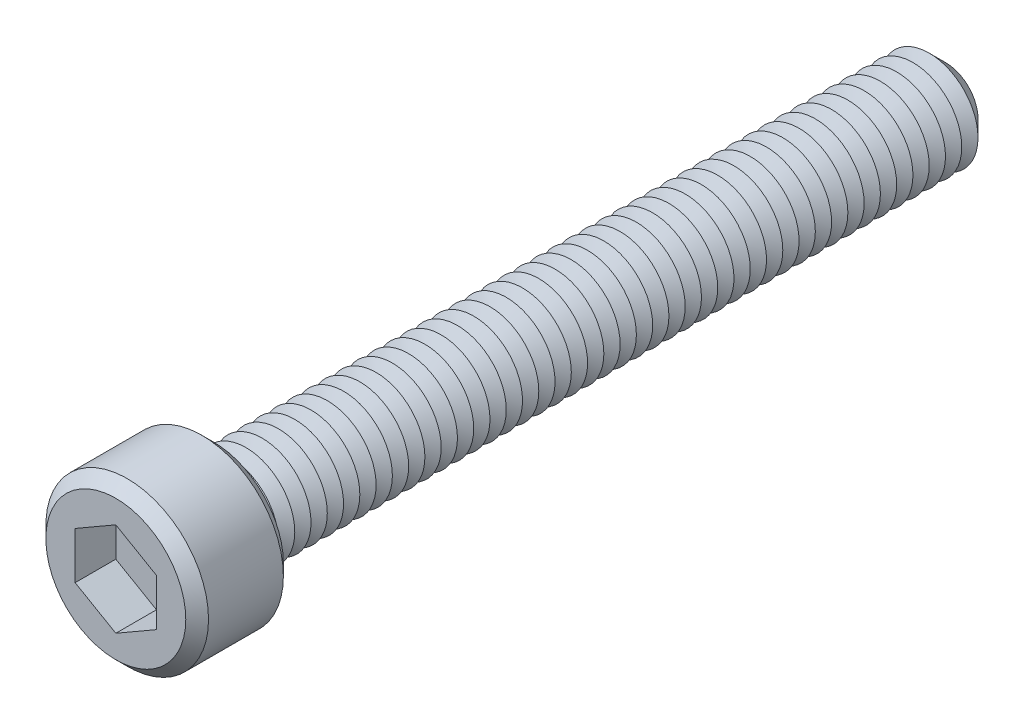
ISO-10303-21;
HEADER;
FILE_DESCRIPTION(('STEP AP214'),'2;1');
FILE_NAME('part.step','',(''),(''),'','','');
FILE_SCHEMA(('AUTOMOTIVE_DESIGN { 1 0 10303 214 1 1 1 1 }'));
ENDSEC;
DATA;
#1=APPLICATION_CONTEXT('core data for automotive mechanical design processes');
#2=APPLICATION_PROTOCOL_DEFINITION('international standard','automotive_design',2000,#1);
#3=PRODUCT_CONTEXT('',#1,'mechanical');
#4=PRODUCT('Part','Part','',(#3));
#5=PRODUCT_RELATED_PRODUCT_CATEGORY('part','',(#4));
#6=PRODUCT_DEFINITION_FORMATION('','',#4);
#7=PRODUCT_DEFINITION_CONTEXT('part definition',#1,'design');
#8=PRODUCT_DEFINITION('design','',#6,#7);
#9=PRODUCT_DEFINITION_SHAPE('','',#8);
#10=(LENGTH_UNIT() NAMED_UNIT(*) SI_UNIT(.MILLI.,.METRE.));
#11=(NAMED_UNIT(*) PLANE_ANGLE_UNIT() SI_UNIT($,.RADIAN.));
#12=(NAMED_UNIT(*) SI_UNIT($,.STERADIAN.) SOLID_ANGLE_UNIT());
#13=UNCERTAINTY_MEASURE_WITH_UNIT(LENGTH_MEASURE(1.E-05),#10,'distance_accuracy_value','');
#14=(GEOMETRIC_REPRESENTATION_CONTEXT(3) GLOBAL_UNCERTAINTY_ASSIGNED_CONTEXT((#13)) GLOBAL_UNIT_ASSIGNED_CONTEXT((#10,
#11,#12)) REPRESENTATION_CONTEXT('',''));
#15=CARTESIAN_POINT('',(0.,0.,0.));
#16=DIRECTION('',(0.,0.,1.));
#17=DIRECTION('',(1.,0.,0.));
#18=AXIS2_PLACEMENT_3D('',#15,#16,#17);
#19=CARTESIAN_POINT('',(0.,0.,6.));
#20=DIRECTION('',(0.,0.,-1.));
#21=DIRECTION('',(-1.,0.,0.));
#22=AXIS2_PLACEMENT_3D('',#19,#20,#21);
#23=CYLINDRICAL_SURFACE('',#22,5.);
#24=CARTESIAN_POINT('',(0.,0.,0.699999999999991));
#25=DIRECTION('',(0.,0.,1.));
#26=DIRECTION('',(1.,0.,0.));
#27=AXIS2_PLACEMENT_3D('',#24,#25,#26);
#28=CIRCLE('',#27,5.);
#29=CARTESIAN_POINT('',(5.,0.,0.699999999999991));
#30=VERTEX_POINT('',#29);
#31=EDGE_CURVE('E529',#30,#30,#28,.T.);
#32=ORIENTED_EDGE('',*,*,#31,.T.);
#33=EDGE_LOOP('',(#32));
#34=FACE_BOUND('',#33,.T.);
#35=CARTESIAN_POINT('',(0.,0.,5.3));
#36=DIRECTION('',(0.,0.,1.));
#37=DIRECTION('',(1.,0.,0.));
#38=AXIS2_PLACEMENT_3D('',#35,#36,#37);
#39=CIRCLE('',#38,5.);
#40=CARTESIAN_POINT('',(5.,0.,5.3));
#41=VERTEX_POINT('',#40);
#42=EDGE_CURVE('E525',#41,#41,#39,.F.);
#43=ORIENTED_EDGE('',*,*,#42,.T.);
#44=EDGE_LOOP('',(#43));
#45=FACE_BOUND('',#44,.T.);
#46=ADVANCED_FACE('F39',(#34,#45),#23,.T.);
#47=CARTESIAN_POINT('',(0.,0.,6.));
#48=DIRECTION('',(0.,0.,1.));
#49=DIRECTION('',(1.,0.,0.));
#50=AXIS2_PLACEMENT_3D('',#47,#48,#49);
#51=PLANE('',#50);
#52=CARTESIAN_POINT('',(0.,0.,6.));
#53=DIRECTION('',(0.,0.,1.));
#54=DIRECTION('',(1.,0.,0.));
#55=AXIS2_PLACEMENT_3D('',#52,#53,#54);
#56=CIRCLE('',#55,4.3);
#57=CARTESIAN_POINT('',(4.3,0.,6.));
#58=VERTEX_POINT('',#57);
#59=EDGE_CURVE('E11',#58,#58,#56,.T.);
#60=ORIENTED_EDGE('',*,*,#59,.T.);
#61=EDGE_LOOP('',(#60));
#62=FACE_BOUND('',#61,.T.);
#63=DIRECTION('',(-0.866025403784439,0.5,0.));
#64=VECTOR('',#63,1.);
#65=CARTESIAN_POINT('',(2.5,1.44337567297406,6.));
#66=LINE('',#65,#64);
#67=CARTESIAN_POINT('',(2.5,1.44337567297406,6.));
#68=VERTEX_POINT('',#67);
#69=CARTESIAN_POINT('',(0.,2.88675134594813,6.));
#70=VERTEX_POINT('',#69);
#71=EDGE_CURVE('E55',#68,#70,#66,.T.);
#72=ORIENTED_EDGE('',*,*,#71,.F.);
#73=DIRECTION('',(0.,1.,0.));
#74=VECTOR('',#73,1.);
#75=CARTESIAN_POINT('',(2.5,-1.44337567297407,6.));
#76=LINE('',#75,#74);
#77=CARTESIAN_POINT('',(2.5,-1.44337567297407,6.));
#78=VERTEX_POINT('',#77);
#79=EDGE_CURVE('E151',#78,#68,#76,.T.);
#80=ORIENTED_EDGE('',*,*,#79,.F.);
#81=DIRECTION('',(0.866025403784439,0.5,0.));
#82=VECTOR('',#81,1.);
#83=CARTESIAN_POINT('',(0.,-2.88675134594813,6.));
#84=LINE('',#83,#82);
#85=CARTESIAN_POINT('',(0.,-2.88675134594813,6.));
#86=VERTEX_POINT('',#85);
#87=EDGE_CURVE('E148',#86,#78,#84,.T.);
#88=ORIENTED_EDGE('',*,*,#87,.F.);
#89=DIRECTION('',(0.866025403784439,-0.5,0.));
#90=VECTOR('',#89,1.);
#91=CARTESIAN_POINT('',(-2.5,-1.44337567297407,6.));
#92=LINE('',#91,#90);
#93=CARTESIAN_POINT('',(-2.5,-1.44337567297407,6.));
#94=VERTEX_POINT('',#93);
#95=EDGE_CURVE('E103',#94,#86,#92,.T.);
#96=ORIENTED_EDGE('',*,*,#95,.F.);
#97=DIRECTION('',(0.,-1.,0.));
#98=VECTOR('',#97,1.);
#99=CARTESIAN_POINT('',(-2.5,1.44337567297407,6.));
#100=LINE('',#99,#98);
#101=CARTESIAN_POINT('',(-2.5,1.44337567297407,6.));
#102=VERTEX_POINT('',#101);
#103=EDGE_CURVE('E142',#102,#94,#100,.T.);
#104=ORIENTED_EDGE('',*,*,#103,.F.);
#105=DIRECTION('',(-0.866025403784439,-0.5,0.));
#106=VECTOR('',#105,1.);
#107=CARTESIAN_POINT('',(0.,2.88675134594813,6.));
#108=LINE('',#107,#106);
#109=EDGE_CURVE('E137',#70,#102,#108,.T.);
#110=ORIENTED_EDGE('',*,*,#109,.F.);
#111=EDGE_LOOP('',(#72,#80,#88,#96,#104,#110));
#112=FACE_BOUND('',#111,.T.);
#113=ADVANCED_FACE('F547',(#62,#112),#51,.T.);
#114=CARTESIAN_POINT('',(0.,0.,0.));
#115=DIRECTION('',(0.,0.,1.));
#116=DIRECTION('',(1.,0.,0.));
#117=AXIS2_PLACEMENT_3D('',#114,#115,#116);
#118=PLANE('',#117);
#119=CARTESIAN_POINT('',(0.,0.,0.));
#120=DIRECTION('',(0.,0.,1.));
#121=DIRECTION('',(1.,0.,0.));
#122=AXIS2_PLACEMENT_3D('',#119,#120,#121);
#123=CIRCLE('',#122,4.30000000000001);
#124=CARTESIAN_POINT('',(4.30000000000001,0.,0.));
#125=VERTEX_POINT('',#124);
#126=EDGE_CURVE('E48',#125,#125,#123,.F.);
#127=ORIENTED_EDGE('',*,*,#126,.T.);
#128=EDGE_LOOP('',(#127));
#129=FACE_BOUND('',#128,.T.);
#130=CARTESIAN_POINT('',(0.,0.,0.));
#131=DIRECTION('',(0.,0.,1.));
#132=DIRECTION('',(1.,0.,0.));
#133=AXIS2_PLACEMENT_3D('',#130,#131,#132);
#134=CIRCLE('',#133,3.);
#135=CARTESIAN_POINT('',(3.,0.,0.));
#136=VERTEX_POINT('',#135);
#137=EDGE_CURVE('E517',#136,#136,#134,.T.);
#138=ORIENTED_EDGE('',*,*,#137,.T.);
#139=EDGE_LOOP('',(#138));
#140=FACE_BOUND('',#139,.T.);
#141=ADVANCED_FACE('F536',(#129,#140),#118,.F.);
#142=CARTESIAN_POINT('',(0.,0.,0.));
#143=DIRECTION('',(0.,0.,1.));
#144=DIRECTION('',(1.,0.,0.));
#145=AXIS2_PLACEMENT_3D('',#142,#143,#144);
#146=CONICAL_SURFACE('',#145,3.,1.0471975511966);
#147=CARTESIAN_POINT('',(0.,0.,-0.5));
#148=DIRECTION('',(0.,0.,1.));
#149=DIRECTION('',(1.,0.,0.));
#150=AXIS2_PLACEMENT_3D('',#147,#148,#149);
#151=CIRCLE('',#150,2.13397459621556);
#152=CARTESIAN_POINT('',(2.13397459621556,0.,-0.5));
#153=VERTEX_POINT('',#152);
#154=EDGE_CURVE('E513',#153,#153,#151,.T.);
#155=ORIENTED_EDGE('',*,*,#154,.T.);
#156=EDGE_LOOP('',(#155));
#157=FACE_BOUND('',#156,.T.);
#158=ORIENTED_EDGE('',*,*,#137,.F.);
#159=EDGE_LOOP('',(#158));
#160=FACE_BOUND('',#159,.T.);
#161=ADVANCED_FACE('F948',(#157,#160),#146,.T.);
#162=CARTESIAN_POINT('',(0.,0.,-0.5));
#163=DIRECTION('',(0.,0.,-1.));
#164=DIRECTION('',(-1.,0.,0.));
#165=AXIS2_PLACEMENT_3D('',#162,#163,#164);
#166=CONICAL_SURFACE('',#165,2.13397459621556,1.0471975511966);
#167=CARTESIAN_POINT('',(0.,0.,-1.));
#168=DIRECTION('',(0.,0.,1.));
#169=DIRECTION('',(1.,0.,0.));
#170=AXIS2_PLACEMENT_3D('',#167,#168,#169);
#171=CIRCLE('',#170,3.);
#172=CARTESIAN_POINT('',(3.,0.,-1.));
#173=VERTEX_POINT('',#172);
#174=EDGE_CURVE('E509',#173,#173,#171,.T.);
#175=ORIENTED_EDGE('',*,*,#174,.T.);
#176=EDGE_LOOP('',(#175));
#177=FACE_BOUND('',#176,.T.);
#178=ORIENTED_EDGE('',*,*,#154,.F.);
#179=EDGE_LOOP('',(#178));
#180=FACE_BOUND('',#179,.T.);
#181=ADVANCED_FACE('F944',(#177,#180),#166,.T.);
#182=CARTESIAN_POINT('',(0.,0.,-1.));
#183=DIRECTION('',(0.,0.,1.));
#184=DIRECTION('',(1.,0.,0.));
#185=AXIS2_PLACEMENT_3D('',#182,#183,#184);
#186=CONICAL_SURFACE('',#185,3.,1.0471975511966);
#187=CARTESIAN_POINT('',(0.,0.,-1.5));
#188=DIRECTION('',(0.,0.,1.));
#189=DIRECTION('',(1.,0.,0.));
#190=AXIS2_PLACEMENT_3D('',#187,#188,#189);
#191=CIRCLE('',#190,2.13397459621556);
#192=CARTESIAN_POINT('',(2.13397459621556,0.,-1.5));
#193=VERTEX_POINT('',#192);
#194=EDGE_CURVE('E505',#193,#193,#191,.T.);
#195=ORIENTED_EDGE('',*,*,#194,.T.);
#196=EDGE_LOOP('',(#195));
#197=FACE_BOUND('',#196,.T.);
#198=ORIENTED_EDGE('',*,*,#174,.F.);
#199=EDGE_LOOP('',(#198));
#200=FACE_BOUND('',#199,.T.);
#201=ADVANCED_FACE('F940',(#197,#200),#186,.T.);
#202=CARTESIAN_POINT('',(0.,0.,-1.5));
#203=DIRECTION('',(0.,0.,-1.));
#204=DIRECTION('',(-1.,0.,0.));
#205=AXIS2_PLACEMENT_3D('',#202,#203,#204);
#206=CONICAL_SURFACE('',#205,2.13397459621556,1.0471975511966);
#207=CARTESIAN_POINT('',(0.,0.,-2.));
#208=DIRECTION('',(0.,0.,1.));
#209=DIRECTION('',(1.,0.,0.));
#210=AXIS2_PLACEMENT_3D('',#207,#208,#209);
#211=CIRCLE('',#210,3.);
#212=CARTESIAN_POINT('',(3.,0.,-2.));
#213=VERTEX_POINT('',#212);
#214=EDGE_CURVE('E501',#213,#213,#211,.T.);
#215=ORIENTED_EDGE('',*,*,#214,.T.);
#216=EDGE_LOOP('',(#215));
#217=FACE_BOUND('',#216,.T.);
#218=ORIENTED_EDGE('',*,*,#194,.F.);
#219=EDGE_LOOP('',(#218));
#220=FACE_BOUND('',#219,.T.);
#221=ADVANCED_FACE('F936',(#217,#220),#206,.T.);
#222=CARTESIAN_POINT('',(0.,0.,-2.));
#223=DIRECTION('',(0.,0.,1.));
#224=DIRECTION('',(1.,0.,0.));
#225=AXIS2_PLACEMENT_3D('',#222,#223,#224);
#226=CONICAL_SURFACE('',#225,3.,1.0471975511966);
#227=CARTESIAN_POINT('',(0.,0.,-2.5));
#228=DIRECTION('',(0.,0.,1.));
#229=DIRECTION('',(1.,0.,0.));
#230=AXIS2_PLACEMENT_3D('',#227,#228,#229);
#231=CIRCLE('',#230,2.13397459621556);
#232=CARTESIAN_POINT('',(2.13397459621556,0.,-2.5));
#233=VERTEX_POINT('',#232);
#234=EDGE_CURVE('E497',#233,#233,#231,.T.);
#235=ORIENTED_EDGE('',*,*,#234,.T.);
#236=EDGE_LOOP('',(#235));
#237=FACE_BOUND('',#236,.T.);
#238=ORIENTED_EDGE('',*,*,#214,.F.);
#239=EDGE_LOOP('',(#238));
#240=FACE_BOUND('',#239,.T.);
#241=ADVANCED_FACE('F932',(#237,#240),#226,.T.);
#242=CARTESIAN_POINT('',(0.,0.,-2.5));
#243=DIRECTION('',(0.,0.,-1.));
#244=DIRECTION('',(-1.,0.,0.));
#245=AXIS2_PLACEMENT_3D('',#242,#243,#244);
#246=CONICAL_SURFACE('',#245,2.13397459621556,1.0471975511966);
#247=CARTESIAN_POINT('',(0.,0.,-3.));
#248=DIRECTION('',(0.,0.,1.));
#249=DIRECTION('',(1.,0.,0.));
#250=AXIS2_PLACEMENT_3D('',#247,#248,#249);
#251=CIRCLE('',#250,3.);
#252=CARTESIAN_POINT('',(3.,0.,-3.));
#253=VERTEX_POINT('',#252);
#254=EDGE_CURVE('E493',#253,#253,#251,.T.);
#255=ORIENTED_EDGE('',*,*,#254,.T.);
#256=EDGE_LOOP('',(#255));
#257=FACE_BOUND('',#256,.T.);
#258=ORIENTED_EDGE('',*,*,#234,.F.);
#259=EDGE_LOOP('',(#258));
#260=FACE_BOUND('',#259,.T.);
#261=ADVANCED_FACE('F928',(#257,#260),#246,.T.);
#262=CARTESIAN_POINT('',(0.,0.,-3.));
#263=DIRECTION('',(0.,0.,1.));
#264=DIRECTION('',(1.,0.,0.));
#265=AXIS2_PLACEMENT_3D('',#262,#263,#264);
#266=CONICAL_SURFACE('',#265,3.,1.0471975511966);
#267=CARTESIAN_POINT('',(0.,0.,-3.5));
#268=DIRECTION('',(0.,0.,1.));
#269=DIRECTION('',(1.,0.,0.));
#270=AXIS2_PLACEMENT_3D('',#267,#268,#269);
#271=CIRCLE('',#270,2.13397459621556);
#272=CARTESIAN_POINT('',(2.13397459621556,0.,-3.5));
#273=VERTEX_POINT('',#272);
#274=EDGE_CURVE('E489',#273,#273,#271,.T.);
#275=ORIENTED_EDGE('',*,*,#274,.T.);
#276=EDGE_LOOP('',(#275));
#277=FACE_BOUND('',#276,.T.);
#278=ORIENTED_EDGE('',*,*,#254,.F.);
#279=EDGE_LOOP('',(#278));
#280=FACE_BOUND('',#279,.T.);
#281=ADVANCED_FACE('F924',(#277,#280),#266,.T.);
#282=CARTESIAN_POINT('',(0.,0.,-3.5));
#283=DIRECTION('',(0.,0.,-1.));
#284=DIRECTION('',(-1.,0.,0.));
#285=AXIS2_PLACEMENT_3D('',#282,#283,#284);
#286=CONICAL_SURFACE('',#285,2.13397459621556,1.0471975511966);
#287=CARTESIAN_POINT('',(0.,0.,-4.));
#288=DIRECTION('',(0.,0.,1.));
#289=DIRECTION('',(1.,0.,0.));
#290=AXIS2_PLACEMENT_3D('',#287,#288,#289);
#291=CIRCLE('',#290,3.);
#292=CARTESIAN_POINT('',(3.,0.,-4.));
#293=VERTEX_POINT('',#292);
#294=EDGE_CURVE('E485',#293,#293,#291,.T.);
#295=ORIENTED_EDGE('',*,*,#294,.T.);
#296=EDGE_LOOP('',(#295));
#297=FACE_BOUND('',#296,.T.);
#298=ORIENTED_EDGE('',*,*,#274,.F.);
#299=EDGE_LOOP('',(#298));
#300=FACE_BOUND('',#299,.T.);
#301=ADVANCED_FACE('F920',(#297,#300),#286,.T.);
#302=CARTESIAN_POINT('',(0.,0.,-4.));
#303=DIRECTION('',(0.,0.,1.));
#304=DIRECTION('',(1.,0.,0.));
#305=AXIS2_PLACEMENT_3D('',#302,#303,#304);
#306=CONICAL_SURFACE('',#305,3.,1.0471975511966);
#307=CARTESIAN_POINT('',(0.,0.,-4.5));
#308=DIRECTION('',(0.,0.,1.));
#309=DIRECTION('',(1.,0.,0.));
#310=AXIS2_PLACEMENT_3D('',#307,#308,#309);
#311=CIRCLE('',#310,2.13397459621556);
#312=CARTESIAN_POINT('',(2.13397459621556,0.,-4.5));
#313=VERTEX_POINT('',#312);
#314=EDGE_CURVE('E481',#313,#313,#311,.T.);
#315=ORIENTED_EDGE('',*,*,#314,.T.);
#316=EDGE_LOOP('',(#315));
#317=FACE_BOUND('',#316,.T.);
#318=ORIENTED_EDGE('',*,*,#294,.F.);
#319=EDGE_LOOP('',(#318));
#320=FACE_BOUND('',#319,.T.);
#321=ADVANCED_FACE('F916',(#317,#320),#306,.T.);
#322=CARTESIAN_POINT('',(0.,0.,-4.5));
#323=DIRECTION('',(0.,0.,-1.));
#324=DIRECTION('',(-1.,0.,0.));
#325=AXIS2_PLACEMENT_3D('',#322,#323,#324);
#326=CONICAL_SURFACE('',#325,2.13397459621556,1.0471975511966);
#327=CARTESIAN_POINT('',(0.,0.,-5.));
#328=DIRECTION('',(0.,0.,1.));
#329=DIRECTION('',(1.,0.,0.));
#330=AXIS2_PLACEMENT_3D('',#327,#328,#329);
#331=CIRCLE('',#330,3.);
#332=CARTESIAN_POINT('',(3.,0.,-5.));
#333=VERTEX_POINT('',#332);
#334=EDGE_CURVE('E477',#333,#333,#331,.T.);
#335=ORIENTED_EDGE('',*,*,#334,.T.);
#336=EDGE_LOOP('',(#335));
#337=FACE_BOUND('',#336,.T.);
#338=ORIENTED_EDGE('',*,*,#314,.F.);
#339=EDGE_LOOP('',(#338));
#340=FACE_BOUND('',#339,.T.);
#341=ADVANCED_FACE('F912',(#337,#340),#326,.T.);
#342=CARTESIAN_POINT('',(0.,0.,-5.));
#343=DIRECTION('',(0.,0.,1.));
#344=DIRECTION('',(1.,0.,0.));
#345=AXIS2_PLACEMENT_3D('',#342,#343,#344);
#346=CONICAL_SURFACE('',#345,3.,1.0471975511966);
#347=CARTESIAN_POINT('',(0.,0.,-5.5));
#348=DIRECTION('',(0.,0.,1.));
#349=DIRECTION('',(1.,0.,0.));
#350=AXIS2_PLACEMENT_3D('',#347,#348,#349);
#351=CIRCLE('',#350,2.13397459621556);
#352=CARTESIAN_POINT('',(2.13397459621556,0.,-5.5));
#353=VERTEX_POINT('',#352);
#354=EDGE_CURVE('E473',#353,#353,#351,.T.);
#355=ORIENTED_EDGE('',*,*,#354,.T.);
#356=EDGE_LOOP('',(#355));
#357=FACE_BOUND('',#356,.T.);
#358=ORIENTED_EDGE('',*,*,#334,.F.);
#359=EDGE_LOOP('',(#358));
#360=FACE_BOUND('',#359,.T.);
#361=ADVANCED_FACE('F908',(#357,#360),#346,.T.);
#362=CARTESIAN_POINT('',(0.,0.,-5.5));
#363=DIRECTION('',(0.,0.,-1.));
#364=DIRECTION('',(-1.,0.,0.));
#365=AXIS2_PLACEMENT_3D('',#362,#363,#364);
#366=CONICAL_SURFACE('',#365,2.13397459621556,1.0471975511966);
#367=CARTESIAN_POINT('',(0.,0.,-6.));
#368=DIRECTION('',(0.,0.,1.));
#369=DIRECTION('',(1.,0.,0.));
#370=AXIS2_PLACEMENT_3D('',#367,#368,#369);
#371=CIRCLE('',#370,3.);
#372=CARTESIAN_POINT('',(3.,0.,-6.));
#373=VERTEX_POINT('',#372);
#374=EDGE_CURVE('E469',#373,#373,#371,.T.);
#375=ORIENTED_EDGE('',*,*,#374,.T.);
#376=EDGE_LOOP('',(#375));
#377=FACE_BOUND('',#376,.T.);
#378=ORIENTED_EDGE('',*,*,#354,.F.);
#379=EDGE_LOOP('',(#378));
#380=FACE_BOUND('',#379,.T.);
#381=ADVANCED_FACE('F904',(#377,#380),#366,.T.);
#382=CARTESIAN_POINT('',(0.,0.,-6.));
#383=DIRECTION('',(0.,0.,1.));
#384=DIRECTION('',(1.,0.,0.));
#385=AXIS2_PLACEMENT_3D('',#382,#383,#384);
#386=CONICAL_SURFACE('',#385,3.,1.0471975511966);
#387=CARTESIAN_POINT('',(0.,0.,-6.5));
#388=DIRECTION('',(0.,0.,1.));
#389=DIRECTION('',(1.,0.,0.));
#390=AXIS2_PLACEMENT_3D('',#387,#388,#389);
#391=CIRCLE('',#390,2.13397459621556);
#392=CARTESIAN_POINT('',(2.13397459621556,0.,-6.5));
#393=VERTEX_POINT('',#392);
#394=EDGE_CURVE('E465',#393,#393,#391,.T.);
#395=ORIENTED_EDGE('',*,*,#394,.T.);
#396=EDGE_LOOP('',(#395));
#397=FACE_BOUND('',#396,.T.);
#398=ORIENTED_EDGE('',*,*,#374,.F.);
#399=EDGE_LOOP('',(#398));
#400=FACE_BOUND('',#399,.T.);
#401=ADVANCED_FACE('F900',(#397,#400),#386,.T.);
#402=CARTESIAN_POINT('',(0.,0.,-6.5));
#403=DIRECTION('',(0.,0.,-1.));
#404=DIRECTION('',(-1.,0.,0.));
#405=AXIS2_PLACEMENT_3D('',#402,#403,#404);
#406=CONICAL_SURFACE('',#405,2.13397459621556,1.0471975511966);
#407=CARTESIAN_POINT('',(0.,0.,-7.));
#408=DIRECTION('',(0.,0.,1.));
#409=DIRECTION('',(1.,0.,0.));
#410=AXIS2_PLACEMENT_3D('',#407,#408,#409);
#411=CIRCLE('',#410,3.);
#412=CARTESIAN_POINT('',(3.,0.,-7.));
#413=VERTEX_POINT('',#412);
#414=EDGE_CURVE('E462',#413,#413,#411,.T.);
#415=ORIENTED_EDGE('',*,*,#414,.T.);
#416=EDGE_LOOP('',(#415));
#417=FACE_BOUND('',#416,.T.);
#418=ORIENTED_EDGE('',*,*,#394,.F.);
#419=EDGE_LOOP('',(#418));
#420=FACE_BOUND('',#419,.T.);
#421=ADVANCED_FACE('F896',(#417,#420),#406,.T.);
#422=CARTESIAN_POINT('',(0.,0.,-7.));
#423=DIRECTION('',(0.,0.,1.));
#424=DIRECTION('',(1.,0.,0.));
#425=AXIS2_PLACEMENT_3D('',#422,#423,#424);
#426=CONICAL_SURFACE('',#425,3.,1.0471975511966);
#427=CARTESIAN_POINT('',(0.,0.,-7.5));
#428=DIRECTION('',(0.,0.,1.));
#429=DIRECTION('',(1.,0.,0.));
#430=AXIS2_PLACEMENT_3D('',#427,#428,#429);
#431=CIRCLE('',#430,2.13397459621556);
#432=CARTESIAN_POINT('',(2.13397459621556,0.,-7.5));
#433=VERTEX_POINT('',#432);
#434=EDGE_CURVE('E458',#433,#433,#431,.T.);
#435=ORIENTED_EDGE('',*,*,#434,.T.);
#436=EDGE_LOOP('',(#435));
#437=FACE_BOUND('',#436,.T.);
#438=ORIENTED_EDGE('',*,*,#414,.F.);
#439=EDGE_LOOP('',(#438));
#440=FACE_BOUND('',#439,.T.);
#441=ADVANCED_FACE('F892',(#437,#440),#426,.T.);
#442=CARTESIAN_POINT('',(0.,0.,-7.5));
#443=DIRECTION('',(0.,0.,-1.));
#444=DIRECTION('',(-1.,0.,0.));
#445=AXIS2_PLACEMENT_3D('',#442,#443,#444);
#446=CONICAL_SURFACE('',#445,2.13397459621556,1.0471975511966);
#447=CARTESIAN_POINT('',(0.,0.,-8.));
#448=DIRECTION('',(0.,0.,1.));
#449=DIRECTION('',(1.,0.,0.));
#450=AXIS2_PLACEMENT_3D('',#447,#448,#449);
#451=CIRCLE('',#450,3.);
#452=CARTESIAN_POINT('',(3.,0.,-8.));
#453=VERTEX_POINT('',#452);
#454=EDGE_CURVE('E454',#453,#453,#451,.T.);
#455=ORIENTED_EDGE('',*,*,#454,.T.);
#456=EDGE_LOOP('',(#455));
#457=FACE_BOUND('',#456,.T.);
#458=ORIENTED_EDGE('',*,*,#434,.F.);
#459=EDGE_LOOP('',(#458));
#460=FACE_BOUND('',#459,.T.);
#461=ADVANCED_FACE('F888',(#457,#460),#446,.T.);
#462=CARTESIAN_POINT('',(0.,0.,-8.));
#463=DIRECTION('',(0.,0.,1.));
#464=DIRECTION('',(1.,0.,0.));
#465=AXIS2_PLACEMENT_3D('',#462,#463,#464);
#466=CONICAL_SURFACE('',#465,3.,1.0471975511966);
#467=CARTESIAN_POINT('',(0.,0.,-8.5));
#468=DIRECTION('',(0.,0.,1.));
#469=DIRECTION('',(1.,0.,0.));
#470=AXIS2_PLACEMENT_3D('',#467,#468,#469);
#471=CIRCLE('',#470,2.13397459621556);
#472=CARTESIAN_POINT('',(2.13397459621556,0.,-8.5));
#473=VERTEX_POINT('',#472);
#474=EDGE_CURVE('E450',#473,#473,#471,.T.);
#475=ORIENTED_EDGE('',*,*,#474,.T.);
#476=EDGE_LOOP('',(#475));
#477=FACE_BOUND('',#476,.T.);
#478=ORIENTED_EDGE('',*,*,#454,.F.);
#479=EDGE_LOOP('',(#478));
#480=FACE_BOUND('',#479,.T.);
#481=ADVANCED_FACE('F884',(#477,#480),#466,.T.);
#482=CARTESIAN_POINT('',(0.,0.,-8.5));
#483=DIRECTION('',(0.,0.,-1.));
#484=DIRECTION('',(-1.,0.,0.));
#485=AXIS2_PLACEMENT_3D('',#482,#483,#484);
#486=CONICAL_SURFACE('',#485,2.13397459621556,1.0471975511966);
#487=CARTESIAN_POINT('',(0.,0.,-9.));
#488=DIRECTION('',(0.,0.,1.));
#489=DIRECTION('',(1.,0.,0.));
#490=AXIS2_PLACEMENT_3D('',#487,#488,#489);
#491=CIRCLE('',#490,3.);
#492=CARTESIAN_POINT('',(3.,0.,-9.));
#493=VERTEX_POINT('',#492);
#494=EDGE_CURVE('E446',#493,#493,#491,.T.);
#495=ORIENTED_EDGE('',*,*,#494,.T.);
#496=EDGE_LOOP('',(#495));
#497=FACE_BOUND('',#496,.T.);
#498=ORIENTED_EDGE('',*,*,#474,.F.);
#499=EDGE_LOOP('',(#498));
#500=FACE_BOUND('',#499,.T.);
#501=ADVANCED_FACE('F880',(#497,#500),#486,.T.);
#502=CARTESIAN_POINT('',(0.,0.,-9.));
#503=DIRECTION('',(0.,0.,1.));
#504=DIRECTION('',(1.,0.,0.));
#505=AXIS2_PLACEMENT_3D('',#502,#503,#504);
#506=CONICAL_SURFACE('',#505,3.,1.0471975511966);
#507=CARTESIAN_POINT('',(0.,0.,-9.5));
#508=DIRECTION('',(0.,0.,1.));
#509=DIRECTION('',(1.,0.,0.));
#510=AXIS2_PLACEMENT_3D('',#507,#508,#509);
#511=CIRCLE('',#510,2.13397459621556);
#512=CARTESIAN_POINT('',(2.13397459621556,0.,-9.5));
#513=VERTEX_POINT('',#512);
#514=EDGE_CURVE('E442',#513,#513,#511,.T.);
#515=ORIENTED_EDGE('',*,*,#514,.T.);
#516=EDGE_LOOP('',(#515));
#517=FACE_BOUND('',#516,.T.);
#518=ORIENTED_EDGE('',*,*,#494,.F.);
#519=EDGE_LOOP('',(#518));
#520=FACE_BOUND('',#519,.T.);
#521=ADVANCED_FACE('F876',(#517,#520),#506,.T.);
#522=CARTESIAN_POINT('',(0.,0.,-9.5));
#523=DIRECTION('',(0.,0.,-1.));
#524=DIRECTION('',(-1.,0.,0.));
#525=AXIS2_PLACEMENT_3D('',#522,#523,#524);
#526=CONICAL_SURFACE('',#525,2.13397459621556,1.0471975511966);
#527=CARTESIAN_POINT('',(0.,0.,-10.));
#528=DIRECTION('',(0.,0.,1.));
#529=DIRECTION('',(1.,0.,0.));
#530=AXIS2_PLACEMENT_3D('',#527,#528,#529);
#531=CIRCLE('',#530,3.);
#532=CARTESIAN_POINT('',(3.,0.,-10.));
#533=VERTEX_POINT('',#532);
#534=EDGE_CURVE('E438',#533,#533,#531,.T.);
#535=ORIENTED_EDGE('',*,*,#534,.T.);
#536=EDGE_LOOP('',(#535));
#537=FACE_BOUND('',#536,.T.);
#538=ORIENTED_EDGE('',*,*,#514,.F.);
#539=EDGE_LOOP('',(#538));
#540=FACE_BOUND('',#539,.T.);
#541=ADVANCED_FACE('F872',(#537,#540),#526,.T.);
#542=CARTESIAN_POINT('',(0.,0.,-10.));
#543=DIRECTION('',(0.,0.,1.));
#544=DIRECTION('',(1.,0.,0.));
#545=AXIS2_PLACEMENT_3D('',#542,#543,#544);
#546=CONICAL_SURFACE('',#545,3.,1.0471975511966);
#547=CARTESIAN_POINT('',(0.,0.,-10.5));
#548=DIRECTION('',(0.,0.,1.));
#549=DIRECTION('',(1.,0.,0.));
#550=AXIS2_PLACEMENT_3D('',#547,#548,#549);
#551=CIRCLE('',#550,2.13397459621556);
#552=CARTESIAN_POINT('',(2.13397459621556,0.,-10.5));
#553=VERTEX_POINT('',#552);
#554=EDGE_CURVE('E434',#553,#553,#551,.T.);
#555=ORIENTED_EDGE('',*,*,#554,.T.);
#556=EDGE_LOOP('',(#555));
#557=FACE_BOUND('',#556,.T.);
#558=ORIENTED_EDGE('',*,*,#534,.F.);
#559=EDGE_LOOP('',(#558));
#560=FACE_BOUND('',#559,.T.);
#561=ADVANCED_FACE('F868',(#557,#560),#546,.T.);
#562=CARTESIAN_POINT('',(0.,0.,-10.5));
#563=DIRECTION('',(0.,0.,-1.));
#564=DIRECTION('',(-1.,0.,0.));
#565=AXIS2_PLACEMENT_3D('',#562,#563,#564);
#566=CONICAL_SURFACE('',#565,2.13397459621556,1.0471975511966);
#567=CARTESIAN_POINT('',(0.,0.,-11.));
#568=DIRECTION('',(0.,0.,1.));
#569=DIRECTION('',(1.,0.,0.));
#570=AXIS2_PLACEMENT_3D('',#567,#568,#569);
#571=CIRCLE('',#570,3.);
#572=CARTESIAN_POINT('',(3.,0.,-11.));
#573=VERTEX_POINT('',#572);
#574=EDGE_CURVE('E430',#573,#573,#571,.T.);
#575=ORIENTED_EDGE('',*,*,#574,.T.);
#576=EDGE_LOOP('',(#575));
#577=FACE_BOUND('',#576,.T.);
#578=ORIENTED_EDGE('',*,*,#554,.F.);
#579=EDGE_LOOP('',(#578));
#580=FACE_BOUND('',#579,.T.);
#581=ADVANCED_FACE('F864',(#577,#580),#566,.T.);
#582=CARTESIAN_POINT('',(0.,0.,-11.));
#583=DIRECTION('',(0.,0.,1.));
#584=DIRECTION('',(1.,0.,0.));
#585=AXIS2_PLACEMENT_3D('',#582,#583,#584);
#586=CONICAL_SURFACE('',#585,3.,1.0471975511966);
#587=CARTESIAN_POINT('',(0.,0.,-11.5));
#588=DIRECTION('',(0.,0.,1.));
#589=DIRECTION('',(1.,0.,0.));
#590=AXIS2_PLACEMENT_3D('',#587,#588,#589);
#591=CIRCLE('',#590,2.13397459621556);
#592=CARTESIAN_POINT('',(2.13397459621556,0.,-11.5));
#593=VERTEX_POINT('',#592);
#594=EDGE_CURVE('E426',#593,#593,#591,.T.);
#595=ORIENTED_EDGE('',*,*,#594,.T.);
#596=EDGE_LOOP('',(#595));
#597=FACE_BOUND('',#596,.T.);
#598=ORIENTED_EDGE('',*,*,#574,.F.);
#599=EDGE_LOOP('',(#598));
#600=FACE_BOUND('',#599,.T.);
#601=ADVANCED_FACE('F860',(#597,#600),#586,.T.);
#602=CARTESIAN_POINT('',(0.,0.,-11.5));
#603=DIRECTION('',(0.,0.,-1.));
#604=DIRECTION('',(-1.,0.,0.));
#605=AXIS2_PLACEMENT_3D('',#602,#603,#604);
#606=CONICAL_SURFACE('',#605,2.13397459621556,1.0471975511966);
#607=CARTESIAN_POINT('',(0.,0.,-12.));
#608=DIRECTION('',(0.,0.,1.));
#609=DIRECTION('',(1.,0.,0.));
#610=AXIS2_PLACEMENT_3D('',#607,#608,#609);
#611=CIRCLE('',#610,3.);
#612=CARTESIAN_POINT('',(3.,0.,-12.));
#613=VERTEX_POINT('',#612);
#614=EDGE_CURVE('E422',#613,#613,#611,.T.);
#615=ORIENTED_EDGE('',*,*,#614,.T.);
#616=EDGE_LOOP('',(#615));
#617=FACE_BOUND('',#616,.T.);
#618=ORIENTED_EDGE('',*,*,#594,.F.);
#619=EDGE_LOOP('',(#618));
#620=FACE_BOUND('',#619,.T.);
#621=ADVANCED_FACE('F856',(#617,#620),#606,.T.);
#622=CARTESIAN_POINT('',(0.,0.,-12.));
#623=DIRECTION('',(0.,0.,1.));
#624=DIRECTION('',(1.,0.,0.));
#625=AXIS2_PLACEMENT_3D('',#622,#623,#624);
#626=CONICAL_SURFACE('',#625,3.,1.0471975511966);
#627=CARTESIAN_POINT('',(0.,0.,-12.5));
#628=DIRECTION('',(0.,0.,1.));
#629=DIRECTION('',(1.,0.,0.));
#630=AXIS2_PLACEMENT_3D('',#627,#628,#629);
#631=CIRCLE('',#630,2.13397459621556);
#632=CARTESIAN_POINT('',(2.13397459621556,0.,-12.5));
#633=VERTEX_POINT('',#632);
#634=EDGE_CURVE('E418',#633,#633,#631,.T.);
#635=ORIENTED_EDGE('',*,*,#634,.T.);
#636=EDGE_LOOP('',(#635));
#637=FACE_BOUND('',#636,.T.);
#638=ORIENTED_EDGE('',*,*,#614,.F.);
#639=EDGE_LOOP('',(#638));
#640=FACE_BOUND('',#639,.T.);
#641=ADVANCED_FACE('F852',(#637,#640),#626,.T.);
#642=CARTESIAN_POINT('',(0.,0.,-12.5));
#643=DIRECTION('',(0.,0.,-1.));
#644=DIRECTION('',(-1.,0.,0.));
#645=AXIS2_PLACEMENT_3D('',#642,#643,#644);
#646=CONICAL_SURFACE('',#645,2.13397459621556,1.0471975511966);
#647=CARTESIAN_POINT('',(0.,0.,-13.));
#648=DIRECTION('',(0.,0.,1.));
#649=DIRECTION('',(1.,0.,0.));
#650=AXIS2_PLACEMENT_3D('',#647,#648,#649);
#651=CIRCLE('',#650,3.);
#652=CARTESIAN_POINT('',(3.,0.,-13.));
#653=VERTEX_POINT('',#652);
#654=EDGE_CURVE('E414',#653,#653,#651,.T.);
#655=ORIENTED_EDGE('',*,*,#654,.T.);
#656=EDGE_LOOP('',(#655));
#657=FACE_BOUND('',#656,.T.);
#658=ORIENTED_EDGE('',*,*,#634,.F.);
#659=EDGE_LOOP('',(#658));
#660=FACE_BOUND('',#659,.T.);
#661=ADVANCED_FACE('F848',(#657,#660),#646,.T.);
#662=CARTESIAN_POINT('',(0.,0.,-13.));
#663=DIRECTION('',(0.,0.,1.));
#664=DIRECTION('',(1.,0.,0.));
#665=AXIS2_PLACEMENT_3D('',#662,#663,#664);
#666=CONICAL_SURFACE('',#665,3.,1.0471975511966);
#667=CARTESIAN_POINT('',(0.,0.,-13.5));
#668=DIRECTION('',(0.,0.,1.));
#669=DIRECTION('',(1.,0.,0.));
#670=AXIS2_PLACEMENT_3D('',#667,#668,#669);
#671=CIRCLE('',#670,2.13397459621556);
#672=CARTESIAN_POINT('',(2.13397459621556,0.,-13.5));
#673=VERTEX_POINT('',#672);
#674=EDGE_CURVE('E410',#673,#673,#671,.T.);
#675=ORIENTED_EDGE('',*,*,#674,.T.);
#676=EDGE_LOOP('',(#675));
#677=FACE_BOUND('',#676,.T.);
#678=ORIENTED_EDGE('',*,*,#654,.F.);
#679=EDGE_LOOP('',(#678));
#680=FACE_BOUND('',#679,.T.);
#681=ADVANCED_FACE('F844',(#677,#680),#666,.T.);
#682=CARTESIAN_POINT('',(0.,0.,-13.5));
#683=DIRECTION('',(0.,0.,-1.));
#684=DIRECTION('',(-1.,0.,0.));
#685=AXIS2_PLACEMENT_3D('',#682,#683,#684);
#686=CONICAL_SURFACE('',#685,2.13397459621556,1.0471975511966);
#687=CARTESIAN_POINT('',(0.,0.,-14.));
#688=DIRECTION('',(0.,0.,1.));
#689=DIRECTION('',(1.,0.,0.));
#690=AXIS2_PLACEMENT_3D('',#687,#688,#689);
#691=CIRCLE('',#690,3.);
#692=CARTESIAN_POINT('',(3.,0.,-14.));
#693=VERTEX_POINT('',#692);
#694=EDGE_CURVE('E406',#693,#693,#691,.T.);
#695=ORIENTED_EDGE('',*,*,#694,.T.);
#696=EDGE_LOOP('',(#695));
#697=FACE_BOUND('',#696,.T.);
#698=ORIENTED_EDGE('',*,*,#674,.F.);
#699=EDGE_LOOP('',(#698));
#700=FACE_BOUND('',#699,.T.);
#701=ADVANCED_FACE('F840',(#697,#700),#686,.T.);
#702=CARTESIAN_POINT('',(0.,0.,-14.));
#703=DIRECTION('',(0.,0.,1.));
#704=DIRECTION('',(1.,0.,0.));
#705=AXIS2_PLACEMENT_3D('',#702,#703,#704);
#706=CONICAL_SURFACE('',#705,3.,1.0471975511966);
#707=CARTESIAN_POINT('',(0.,0.,-14.5));
#708=DIRECTION('',(0.,0.,1.));
#709=DIRECTION('',(1.,0.,0.));
#710=AXIS2_PLACEMENT_3D('',#707,#708,#709);
#711=CIRCLE('',#710,2.13397459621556);
#712=CARTESIAN_POINT('',(2.13397459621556,0.,-14.5));
#713=VERTEX_POINT('',#712);
#714=EDGE_CURVE('E402',#713,#713,#711,.T.);
#715=ORIENTED_EDGE('',*,*,#714,.T.);
#716=EDGE_LOOP('',(#715));
#717=FACE_BOUND('',#716,.T.);
#718=ORIENTED_EDGE('',*,*,#694,.F.);
#719=EDGE_LOOP('',(#718));
#720=FACE_BOUND('',#719,.T.);
#721=ADVANCED_FACE('F836',(#717,#720),#706,.T.);
#722=CARTESIAN_POINT('',(0.,0.,-14.5));
#723=DIRECTION('',(0.,0.,-1.));
#724=DIRECTION('',(-1.,0.,0.));
#725=AXIS2_PLACEMENT_3D('',#722,#723,#724);
#726=CONICAL_SURFACE('',#725,2.13397459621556,1.0471975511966);
#727=CARTESIAN_POINT('',(0.,0.,-15.));
#728=DIRECTION('',(0.,0.,1.));
#729=DIRECTION('',(1.,0.,0.));
#730=AXIS2_PLACEMENT_3D('',#727,#728,#729);
#731=CIRCLE('',#730,3.);
#732=CARTESIAN_POINT('',(3.,0.,-15.));
#733=VERTEX_POINT('',#732);
#734=EDGE_CURVE('E398',#733,#733,#731,.T.);
#735=ORIENTED_EDGE('',*,*,#734,.T.);
#736=EDGE_LOOP('',(#735));
#737=FACE_BOUND('',#736,.T.);
#738=ORIENTED_EDGE('',*,*,#714,.F.);
#739=EDGE_LOOP('',(#738));
#740=FACE_BOUND('',#739,.T.);
#741=ADVANCED_FACE('F832',(#737,#740),#726,.T.);
#742=CARTESIAN_POINT('',(0.,0.,-15.));
#743=DIRECTION('',(0.,0.,1.));
#744=DIRECTION('',(1.,0.,0.));
#745=AXIS2_PLACEMENT_3D('',#742,#743,#744);
#746=CONICAL_SURFACE('',#745,3.,1.0471975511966);
#747=CARTESIAN_POINT('',(0.,0.,-15.5));
#748=DIRECTION('',(0.,0.,1.));
#749=DIRECTION('',(1.,0.,0.));
#750=AXIS2_PLACEMENT_3D('',#747,#748,#749);
#751=CIRCLE('',#750,2.13397459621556);
#752=CARTESIAN_POINT('',(2.13397459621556,0.,-15.5));
#753=VERTEX_POINT('',#752);
#754=EDGE_CURVE('E394',#753,#753,#751,.T.);
#755=ORIENTED_EDGE('',*,*,#754,.T.);
#756=EDGE_LOOP('',(#755));
#757=FACE_BOUND('',#756,.T.);
#758=ORIENTED_EDGE('',*,*,#734,.F.);
#759=EDGE_LOOP('',(#758));
#760=FACE_BOUND('',#759,.T.);
#761=ADVANCED_FACE('F828',(#757,#760),#746,.T.);
#762=CARTESIAN_POINT('',(0.,0.,-15.5));
#763=DIRECTION('',(0.,0.,-1.));
#764=DIRECTION('',(-1.,0.,0.));
#765=AXIS2_PLACEMENT_3D('',#762,#763,#764);
#766=CONICAL_SURFACE('',#765,2.13397459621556,1.0471975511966);
#767=CARTESIAN_POINT('',(0.,0.,-16.));
#768=DIRECTION('',(0.,0.,1.));
#769=DIRECTION('',(1.,0.,0.));
#770=AXIS2_PLACEMENT_3D('',#767,#768,#769);
#771=CIRCLE('',#770,3.);
#772=CARTESIAN_POINT('',(3.,0.,-16.));
#773=VERTEX_POINT('',#772);
#774=EDGE_CURVE('E390',#773,#773,#771,.T.);
#775=ORIENTED_EDGE('',*,*,#774,.T.);
#776=EDGE_LOOP('',(#775));
#777=FACE_BOUND('',#776,.T.);
#778=ORIENTED_EDGE('',*,*,#754,.F.);
#779=EDGE_LOOP('',(#778));
#780=FACE_BOUND('',#779,.T.);
#781=ADVANCED_FACE('F824',(#777,#780),#766,.T.);
#782=CARTESIAN_POINT('',(0.,0.,-16.));
#783=DIRECTION('',(0.,0.,1.));
#784=DIRECTION('',(1.,0.,0.));
#785=AXIS2_PLACEMENT_3D('',#782,#783,#784);
#786=CONICAL_SURFACE('',#785,3.,1.0471975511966);
#787=CARTESIAN_POINT('',(0.,0.,-16.5));
#788=DIRECTION('',(0.,0.,1.));
#789=DIRECTION('',(1.,0.,0.));
#790=AXIS2_PLACEMENT_3D('',#787,#788,#789);
#791=CIRCLE('',#790,2.13397459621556);
#792=CARTESIAN_POINT('',(2.13397459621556,0.,-16.5));
#793=VERTEX_POINT('',#792);
#794=EDGE_CURVE('E386',#793,#793,#791,.T.);
#795=ORIENTED_EDGE('',*,*,#794,.T.);
#796=EDGE_LOOP('',(#795));
#797=FACE_BOUND('',#796,.T.);
#798=ORIENTED_EDGE('',*,*,#774,.F.);
#799=EDGE_LOOP('',(#798));
#800=FACE_BOUND('',#799,.T.);
#801=ADVANCED_FACE('F820',(#797,#800),#786,.T.);
#802=CARTESIAN_POINT('',(0.,0.,-16.5));
#803=DIRECTION('',(0.,0.,-1.));
#804=DIRECTION('',(-1.,0.,0.));
#805=AXIS2_PLACEMENT_3D('',#802,#803,#804);
#806=CONICAL_SURFACE('',#805,2.13397459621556,1.0471975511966);
#807=CARTESIAN_POINT('',(0.,0.,-17.));
#808=DIRECTION('',(0.,0.,1.));
#809=DIRECTION('',(1.,0.,0.));
#810=AXIS2_PLACEMENT_3D('',#807,#808,#809);
#811=CIRCLE('',#810,3.);
#812=CARTESIAN_POINT('',(3.,0.,-17.));
#813=VERTEX_POINT('',#812);
#814=EDGE_CURVE('E382',#813,#813,#811,.T.);
#815=ORIENTED_EDGE('',*,*,#814,.T.);
#816=EDGE_LOOP('',(#815));
#817=FACE_BOUND('',#816,.T.);
#818=ORIENTED_EDGE('',*,*,#794,.F.);
#819=EDGE_LOOP('',(#818));
#820=FACE_BOUND('',#819,.T.);
#821=ADVANCED_FACE('F816',(#817,#820),#806,.T.);
#822=CARTESIAN_POINT('',(0.,0.,-17.));
#823=DIRECTION('',(0.,0.,1.));
#824=DIRECTION('',(1.,0.,0.));
#825=AXIS2_PLACEMENT_3D('',#822,#823,#824);
#826=CONICAL_SURFACE('',#825,3.,1.0471975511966);
#827=CARTESIAN_POINT('',(0.,0.,-17.5));
#828=DIRECTION('',(0.,0.,1.));
#829=DIRECTION('',(1.,0.,0.));
#830=AXIS2_PLACEMENT_3D('',#827,#828,#829);
#831=CIRCLE('',#830,2.13397459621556);
#832=CARTESIAN_POINT('',(2.13397459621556,0.,-17.5));
#833=VERTEX_POINT('',#832);
#834=EDGE_CURVE('E378',#833,#833,#831,.T.);
#835=ORIENTED_EDGE('',*,*,#834,.T.);
#836=EDGE_LOOP('',(#835));
#837=FACE_BOUND('',#836,.T.);
#838=ORIENTED_EDGE('',*,*,#814,.F.);
#839=EDGE_LOOP('',(#838));
#840=FACE_BOUND('',#839,.T.);
#841=ADVANCED_FACE('F812',(#837,#840),#826,.T.);
#842=CARTESIAN_POINT('',(0.,0.,-17.5));
#843=DIRECTION('',(0.,0.,-1.));
#844=DIRECTION('',(-1.,0.,0.));
#845=AXIS2_PLACEMENT_3D('',#842,#843,#844);
#846=CONICAL_SURFACE('',#845,2.13397459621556,1.0471975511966);
#847=CARTESIAN_POINT('',(0.,0.,-18.));
#848=DIRECTION('',(0.,0.,1.));
#849=DIRECTION('',(1.,0.,0.));
#850=AXIS2_PLACEMENT_3D('',#847,#848,#849);
#851=CIRCLE('',#850,3.);
#852=CARTESIAN_POINT('',(3.,0.,-18.));
#853=VERTEX_POINT('',#852);
#854=EDGE_CURVE('E374',#853,#853,#851,.T.);
#855=ORIENTED_EDGE('',*,*,#854,.T.);
#856=EDGE_LOOP('',(#855));
#857=FACE_BOUND('',#856,.T.);
#858=ORIENTED_EDGE('',*,*,#834,.F.);
#859=EDGE_LOOP('',(#858));
#860=FACE_BOUND('',#859,.T.);
#861=ADVANCED_FACE('F808',(#857,#860),#846,.T.);
#862=CARTESIAN_POINT('',(0.,0.,-18.));
#863=DIRECTION('',(0.,0.,1.));
#864=DIRECTION('',(1.,0.,0.));
#865=AXIS2_PLACEMENT_3D('',#862,#863,#864);
#866=CONICAL_SURFACE('',#865,3.,1.0471975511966);
#867=CARTESIAN_POINT('',(0.,0.,-18.5));
#868=DIRECTION('',(0.,0.,1.));
#869=DIRECTION('',(1.,0.,0.));
#870=AXIS2_PLACEMENT_3D('',#867,#868,#869);
#871=CIRCLE('',#870,2.13397459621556);
#872=CARTESIAN_POINT('',(2.13397459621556,0.,-18.5));
#873=VERTEX_POINT('',#872);
#874=EDGE_CURVE('E370',#873,#873,#871,.T.);
#875=ORIENTED_EDGE('',*,*,#874,.T.);
#876=EDGE_LOOP('',(#875));
#877=FACE_BOUND('',#876,.T.);
#878=ORIENTED_EDGE('',*,*,#854,.F.);
#879=EDGE_LOOP('',(#878));
#880=FACE_BOUND('',#879,.T.);
#881=ADVANCED_FACE('F804',(#877,#880),#866,.T.);
#882=CARTESIAN_POINT('',(0.,0.,-18.5));
#883=DIRECTION('',(0.,0.,-1.));
#884=DIRECTION('',(-1.,0.,0.));
#885=AXIS2_PLACEMENT_3D('',#882,#883,#884);
#886=CONICAL_SURFACE('',#885,2.13397459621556,1.0471975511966);
#887=CARTESIAN_POINT('',(0.,0.,-19.));
#888=DIRECTION('',(0.,0.,1.));
#889=DIRECTION('',(1.,0.,0.));
#890=AXIS2_PLACEMENT_3D('',#887,#888,#889);
#891=CIRCLE('',#890,3.);
#892=CARTESIAN_POINT('',(3.,0.,-19.));
#893=VERTEX_POINT('',#892);
#894=EDGE_CURVE('E366',#893,#893,#891,.T.);
#895=ORIENTED_EDGE('',*,*,#894,.T.);
#896=EDGE_LOOP('',(#895));
#897=FACE_BOUND('',#896,.T.);
#898=ORIENTED_EDGE('',*,*,#874,.F.);
#899=EDGE_LOOP('',(#898));
#900=FACE_BOUND('',#899,.T.);
#901=ADVANCED_FACE('F800',(#897,#900),#886,.T.);
#902=CARTESIAN_POINT('',(0.,0.,-19.));
#903=DIRECTION('',(0.,0.,1.));
#904=DIRECTION('',(1.,0.,0.));
#905=AXIS2_PLACEMENT_3D('',#902,#903,#904);
#906=CONICAL_SURFACE('',#905,3.,1.0471975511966);
#907=CARTESIAN_POINT('',(0.,0.,-19.5));
#908=DIRECTION('',(0.,0.,1.));
#909=DIRECTION('',(1.,0.,0.));
#910=AXIS2_PLACEMENT_3D('',#907,#908,#909);
#911=CIRCLE('',#910,2.13397459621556);
#912=CARTESIAN_POINT('',(2.13397459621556,0.,-19.5));
#913=VERTEX_POINT('',#912);
#914=EDGE_CURVE('E362',#913,#913,#911,.T.);
#915=ORIENTED_EDGE('',*,*,#914,.T.);
#916=EDGE_LOOP('',(#915));
#917=FACE_BOUND('',#916,.T.);
#918=ORIENTED_EDGE('',*,*,#894,.F.);
#919=EDGE_LOOP('',(#918));
#920=FACE_BOUND('',#919,.T.);
#921=ADVANCED_FACE('F796',(#917,#920),#906,.T.);
#922=CARTESIAN_POINT('',(0.,0.,-19.5));
#923=DIRECTION('',(0.,0.,-1.));
#924=DIRECTION('',(-1.,0.,0.));
#925=AXIS2_PLACEMENT_3D('',#922,#923,#924);
#926=CONICAL_SURFACE('',#925,2.13397459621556,1.0471975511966);
#927=CARTESIAN_POINT('',(0.,0.,-20.));
#928=DIRECTION('',(0.,0.,1.));
#929=DIRECTION('',(1.,0.,0.));
#930=AXIS2_PLACEMENT_3D('',#927,#928,#929);
#931=CIRCLE('',#930,3.);
#932=CARTESIAN_POINT('',(3.,0.,-20.));
#933=VERTEX_POINT('',#932);
#934=EDGE_CURVE('E358',#933,#933,#931,.T.);
#935=ORIENTED_EDGE('',*,*,#934,.T.);
#936=EDGE_LOOP('',(#935));
#937=FACE_BOUND('',#936,.T.);
#938=ORIENTED_EDGE('',*,*,#914,.F.);
#939=EDGE_LOOP('',(#938));
#940=FACE_BOUND('',#939,.T.);
#941=ADVANCED_FACE('F792',(#937,#940),#926,.T.);
#942=CARTESIAN_POINT('',(0.,0.,-20.));
#943=DIRECTION('',(0.,0.,1.));
#944=DIRECTION('',(1.,0.,0.));
#945=AXIS2_PLACEMENT_3D('',#942,#943,#944);
#946=CONICAL_SURFACE('',#945,3.,1.0471975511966);
#947=CARTESIAN_POINT('',(0.,0.,-20.5));
#948=DIRECTION('',(0.,0.,1.));
#949=DIRECTION('',(1.,0.,0.));
#950=AXIS2_PLACEMENT_3D('',#947,#948,#949);
#951=CIRCLE('',#950,2.13397459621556);
#952=CARTESIAN_POINT('',(2.13397459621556,0.,-20.5));
#953=VERTEX_POINT('',#952);
#954=EDGE_CURVE('E354',#953,#953,#951,.T.);
#955=ORIENTED_EDGE('',*,*,#954,.T.);
#956=EDGE_LOOP('',(#955));
#957=FACE_BOUND('',#956,.T.);
#958=ORIENTED_EDGE('',*,*,#934,.F.);
#959=EDGE_LOOP('',(#958));
#960=FACE_BOUND('',#959,.T.);
#961=ADVANCED_FACE('F788',(#957,#960),#946,.T.);
#962=CARTESIAN_POINT('',(0.,0.,-20.5));
#963=DIRECTION('',(0.,0.,-1.));
#964=DIRECTION('',(-1.,0.,0.));
#965=AXIS2_PLACEMENT_3D('',#962,#963,#964);
#966=CONICAL_SURFACE('',#965,2.13397459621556,1.0471975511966);
#967=CARTESIAN_POINT('',(0.,0.,-21.));
#968=DIRECTION('',(0.,0.,1.));
#969=DIRECTION('',(1.,0.,0.));
#970=AXIS2_PLACEMENT_3D('',#967,#968,#969);
#971=CIRCLE('',#970,3.);
#972=CARTESIAN_POINT('',(3.,0.,-21.));
#973=VERTEX_POINT('',#972);
#974=EDGE_CURVE('E350',#973,#973,#971,.T.);
#975=ORIENTED_EDGE('',*,*,#974,.T.);
#976=EDGE_LOOP('',(#975));
#977=FACE_BOUND('',#976,.T.);
#978=ORIENTED_EDGE('',*,*,#954,.F.);
#979=EDGE_LOOP('',(#978));
#980=FACE_BOUND('',#979,.T.);
#981=ADVANCED_FACE('F784',(#977,#980),#966,.T.);
#982=CARTESIAN_POINT('',(0.,0.,-21.));
#983=DIRECTION('',(0.,0.,1.));
#984=DIRECTION('',(1.,0.,0.));
#985=AXIS2_PLACEMENT_3D('',#982,#983,#984);
#986=CONICAL_SURFACE('',#985,3.,1.0471975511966);
#987=CARTESIAN_POINT('',(0.,0.,-21.5));
#988=DIRECTION('',(0.,0.,1.));
#989=DIRECTION('',(1.,0.,0.));
#990=AXIS2_PLACEMENT_3D('',#987,#988,#989);
#991=CIRCLE('',#990,2.13397459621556);
#992=CARTESIAN_POINT('',(2.13397459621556,0.,-21.5));
#993=VERTEX_POINT('',#992);
#994=EDGE_CURVE('E346',#993,#993,#991,.T.);
#995=ORIENTED_EDGE('',*,*,#994,.T.);
#996=EDGE_LOOP('',(#995));
#997=FACE_BOUND('',#996,.T.);
#998=ORIENTED_EDGE('',*,*,#974,.F.);
#999=EDGE_LOOP('',(#998));
#1000=FACE_BOUND('',#999,.T.);
#1001=ADVANCED_FACE('F780',(#997,#1000),#986,.T.);
#1002=CARTESIAN_POINT('',(0.,0.,-21.5));
#1003=DIRECTION('',(0.,0.,-1.));
#1004=DIRECTION('',(-1.,0.,0.));
#1005=AXIS2_PLACEMENT_3D('',#1002,#1003,#1004);
#1006=CONICAL_SURFACE('',#1005,2.13397459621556,1.0471975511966);
#1007=CARTESIAN_POINT('',(0.,0.,-22.));
#1008=DIRECTION('',(0.,0.,1.));
#1009=DIRECTION('',(1.,0.,0.));
#1010=AXIS2_PLACEMENT_3D('',#1007,#1008,#1009);
#1011=CIRCLE('',#1010,3.);
#1012=CARTESIAN_POINT('',(3.,0.,-22.));
#1013=VERTEX_POINT('',#1012);
#1014=EDGE_CURVE('E342',#1013,#1013,#1011,.T.);
#1015=ORIENTED_EDGE('',*,*,#1014,.T.);
#1016=EDGE_LOOP('',(#1015));
#1017=FACE_BOUND('',#1016,.T.);
#1018=ORIENTED_EDGE('',*,*,#994,.F.);
#1019=EDGE_LOOP('',(#1018));
#1020=FACE_BOUND('',#1019,.T.);
#1021=ADVANCED_FACE('F776',(#1017,#1020),#1006,.T.);
#1022=CARTESIAN_POINT('',(0.,0.,-22.));
#1023=DIRECTION('',(0.,0.,1.));
#1024=DIRECTION('',(1.,0.,0.));
#1025=AXIS2_PLACEMENT_3D('',#1022,#1023,#1024);
#1026=CONICAL_SURFACE('',#1025,3.,1.0471975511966);
#1027=CARTESIAN_POINT('',(0.,0.,-22.5));
#1028=DIRECTION('',(0.,0.,1.));
#1029=DIRECTION('',(1.,0.,0.));
#1030=AXIS2_PLACEMENT_3D('',#1027,#1028,#1029);
#1031=CIRCLE('',#1030,2.13397459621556);
#1032=CARTESIAN_POINT('',(2.13397459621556,0.,-22.5));
#1033=VERTEX_POINT('',#1032);
#1034=EDGE_CURVE('E338',#1033,#1033,#1031,.T.);
#1035=ORIENTED_EDGE('',*,*,#1034,.T.);
#1036=EDGE_LOOP('',(#1035));
#1037=FACE_BOUND('',#1036,.T.);
#1038=ORIENTED_EDGE('',*,*,#1014,.F.);
#1039=EDGE_LOOP('',(#1038));
#1040=FACE_BOUND('',#1039,.T.);
#1041=ADVANCED_FACE('F772',(#1037,#1040),#1026,.T.);
#1042=CARTESIAN_POINT('',(0.,0.,-22.5));
#1043=DIRECTION('',(0.,0.,-1.));
#1044=DIRECTION('',(-1.,0.,0.));
#1045=AXIS2_PLACEMENT_3D('',#1042,#1043,#1044);
#1046=CONICAL_SURFACE('',#1045,2.13397459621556,1.0471975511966);
#1047=CARTESIAN_POINT('',(0.,0.,-23.));
#1048=DIRECTION('',(0.,0.,1.));
#1049=DIRECTION('',(1.,0.,0.));
#1050=AXIS2_PLACEMENT_3D('',#1047,#1048,#1049);
#1051=CIRCLE('',#1050,3.);
#1052=CARTESIAN_POINT('',(3.,0.,-23.));
#1053=VERTEX_POINT('',#1052);
#1054=EDGE_CURVE('E334',#1053,#1053,#1051,.T.);
#1055=ORIENTED_EDGE('',*,*,#1054,.T.);
#1056=EDGE_LOOP('',(#1055));
#1057=FACE_BOUND('',#1056,.T.);
#1058=ORIENTED_EDGE('',*,*,#1034,.F.);
#1059=EDGE_LOOP('',(#1058));
#1060=FACE_BOUND('',#1059,.T.);
#1061=ADVANCED_FACE('F768',(#1057,#1060),#1046,.T.);
#1062=CARTESIAN_POINT('',(0.,0.,-23.));
#1063=DIRECTION('',(0.,0.,1.));
#1064=DIRECTION('',(1.,0.,0.));
#1065=AXIS2_PLACEMENT_3D('',#1062,#1063,#1064);
#1066=CONICAL_SURFACE('',#1065,3.,1.0471975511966);
#1067=CARTESIAN_POINT('',(0.,0.,-23.5));
#1068=DIRECTION('',(0.,0.,1.));
#1069=DIRECTION('',(1.,0.,0.));
#1070=AXIS2_PLACEMENT_3D('',#1067,#1068,#1069);
#1071=CIRCLE('',#1070,2.13397459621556);
#1072=CARTESIAN_POINT('',(2.13397459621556,0.,-23.5));
#1073=VERTEX_POINT('',#1072);
#1074=EDGE_CURVE('E330',#1073,#1073,#1071,.T.);
#1075=ORIENTED_EDGE('',*,*,#1074,.T.);
#1076=EDGE_LOOP('',(#1075));
#1077=FACE_BOUND('',#1076,.T.);
#1078=ORIENTED_EDGE('',*,*,#1054,.F.);
#1079=EDGE_LOOP('',(#1078));
#1080=FACE_BOUND('',#1079,.T.);
#1081=ADVANCED_FACE('F764',(#1077,#1080),#1066,.T.);
#1082=CARTESIAN_POINT('',(0.,0.,-23.5));
#1083=DIRECTION('',(0.,0.,-1.));
#1084=DIRECTION('',(-1.,0.,0.));
#1085=AXIS2_PLACEMENT_3D('',#1082,#1083,#1084);
#1086=CONICAL_SURFACE('',#1085,2.13397459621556,1.0471975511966);
#1087=CARTESIAN_POINT('',(0.,0.,-24.));
#1088=DIRECTION('',(0.,0.,1.));
#1089=DIRECTION('',(1.,0.,0.));
#1090=AXIS2_PLACEMENT_3D('',#1087,#1088,#1089);
#1091=CIRCLE('',#1090,3.);
#1092=CARTESIAN_POINT('',(3.,0.,-24.));
#1093=VERTEX_POINT('',#1092);
#1094=EDGE_CURVE('E326',#1093,#1093,#1091,.T.);
#1095=ORIENTED_EDGE('',*,*,#1094,.T.);
#1096=EDGE_LOOP('',(#1095));
#1097=FACE_BOUND('',#1096,.T.);
#1098=ORIENTED_EDGE('',*,*,#1074,.F.);
#1099=EDGE_LOOP('',(#1098));
#1100=FACE_BOUND('',#1099,.T.);
#1101=ADVANCED_FACE('F760',(#1097,#1100),#1086,.T.);
#1102=CARTESIAN_POINT('',(0.,0.,-24.));
#1103=DIRECTION('',(0.,0.,1.));
#1104=DIRECTION('',(1.,0.,0.));
#1105=AXIS2_PLACEMENT_3D('',#1102,#1103,#1104);
#1106=CONICAL_SURFACE('',#1105,3.,1.0471975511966);
#1107=CARTESIAN_POINT('',(0.,0.,-24.5));
#1108=DIRECTION('',(0.,0.,1.));
#1109=DIRECTION('',(1.,0.,0.));
#1110=AXIS2_PLACEMENT_3D('',#1107,#1108,#1109);
#1111=CIRCLE('',#1110,2.13397459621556);
#1112=CARTESIAN_POINT('',(2.13397459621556,0.,-24.5));
#1113=VERTEX_POINT('',#1112);
#1114=EDGE_CURVE('E322',#1113,#1113,#1111,.T.);
#1115=ORIENTED_EDGE('',*,*,#1114,.T.);
#1116=EDGE_LOOP('',(#1115));
#1117=FACE_BOUND('',#1116,.T.);
#1118=ORIENTED_EDGE('',*,*,#1094,.F.);
#1119=EDGE_LOOP('',(#1118));
#1120=FACE_BOUND('',#1119,.T.);
#1121=ADVANCED_FACE('F756',(#1117,#1120),#1106,.T.);
#1122=CARTESIAN_POINT('',(0.,0.,-24.5));
#1123=DIRECTION('',(0.,0.,-1.));
#1124=DIRECTION('',(-1.,0.,0.));
#1125=AXIS2_PLACEMENT_3D('',#1122,#1123,#1124);
#1126=CONICAL_SURFACE('',#1125,2.13397459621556,1.0471975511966);
#1127=CARTESIAN_POINT('',(0.,0.,-25.));
#1128=DIRECTION('',(0.,0.,1.));
#1129=DIRECTION('',(1.,0.,0.));
#1130=AXIS2_PLACEMENT_3D('',#1127,#1128,#1129);
#1131=CIRCLE('',#1130,3.);
#1132=CARTESIAN_POINT('',(3.,0.,-25.));
#1133=VERTEX_POINT('',#1132);
#1134=EDGE_CURVE('E318',#1133,#1133,#1131,.T.);
#1135=ORIENTED_EDGE('',*,*,#1134,.T.);
#1136=EDGE_LOOP('',(#1135));
#1137=FACE_BOUND('',#1136,.T.);
#1138=ORIENTED_EDGE('',*,*,#1114,.F.);
#1139=EDGE_LOOP('',(#1138));
#1140=FACE_BOUND('',#1139,.T.);
#1141=ADVANCED_FACE('F752',(#1137,#1140),#1126,.T.);
#1142=CARTESIAN_POINT('',(0.,0.,-25.));
#1143=DIRECTION('',(0.,0.,1.));
#1144=DIRECTION('',(1.,0.,0.));
#1145=AXIS2_PLACEMENT_3D('',#1142,#1143,#1144);
#1146=CONICAL_SURFACE('',#1145,3.,1.0471975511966);
#1147=CARTESIAN_POINT('',(0.,0.,-25.5));
#1148=DIRECTION('',(0.,0.,1.));
#1149=DIRECTION('',(1.,0.,0.));
#1150=AXIS2_PLACEMENT_3D('',#1147,#1148,#1149);
#1151=CIRCLE('',#1150,2.13397459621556);
#1152=CARTESIAN_POINT('',(2.13397459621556,0.,-25.5));
#1153=VERTEX_POINT('',#1152);
#1154=EDGE_CURVE('E314',#1153,#1153,#1151,.T.);
#1155=ORIENTED_EDGE('',*,*,#1154,.T.);
#1156=EDGE_LOOP('',(#1155));
#1157=FACE_BOUND('',#1156,.T.);
#1158=ORIENTED_EDGE('',*,*,#1134,.F.);
#1159=EDGE_LOOP('',(#1158));
#1160=FACE_BOUND('',#1159,.T.);
#1161=ADVANCED_FACE('F748',(#1157,#1160),#1146,.T.);
#1162=CARTESIAN_POINT('',(0.,0.,-25.5));
#1163=DIRECTION('',(0.,0.,-1.));
#1164=DIRECTION('',(-1.,0.,0.));
#1165=AXIS2_PLACEMENT_3D('',#1162,#1163,#1164);
#1166=CONICAL_SURFACE('',#1165,2.13397459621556,1.0471975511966);
#1167=CARTESIAN_POINT('',(0.,0.,-26.));
#1168=DIRECTION('',(0.,0.,1.));
#1169=DIRECTION('',(1.,0.,0.));
#1170=AXIS2_PLACEMENT_3D('',#1167,#1168,#1169);
#1171=CIRCLE('',#1170,3.);
#1172=CARTESIAN_POINT('',(3.,0.,-26.));
#1173=VERTEX_POINT('',#1172);
#1174=EDGE_CURVE('E310',#1173,#1173,#1171,.T.);
#1175=ORIENTED_EDGE('',*,*,#1174,.T.);
#1176=EDGE_LOOP('',(#1175));
#1177=FACE_BOUND('',#1176,.T.);
#1178=ORIENTED_EDGE('',*,*,#1154,.F.);
#1179=EDGE_LOOP('',(#1178));
#1180=FACE_BOUND('',#1179,.T.);
#1181=ADVANCED_FACE('F744',(#1177,#1180),#1166,.T.);
#1182=CARTESIAN_POINT('',(0.,0.,-26.));
#1183=DIRECTION('',(0.,0.,1.));
#1184=DIRECTION('',(1.,0.,0.));
#1185=AXIS2_PLACEMENT_3D('',#1182,#1183,#1184);
#1186=CONICAL_SURFACE('',#1185,3.,1.0471975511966);
#1187=CARTESIAN_POINT('',(0.,0.,-26.5));
#1188=DIRECTION('',(0.,0.,1.));
#1189=DIRECTION('',(1.,0.,0.));
#1190=AXIS2_PLACEMENT_3D('',#1187,#1188,#1189);
#1191=CIRCLE('',#1190,2.13397459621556);
#1192=CARTESIAN_POINT('',(2.13397459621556,0.,-26.5));
#1193=VERTEX_POINT('',#1192);
#1194=EDGE_CURVE('E306',#1193,#1193,#1191,.T.);
#1195=ORIENTED_EDGE('',*,*,#1194,.T.);
#1196=EDGE_LOOP('',(#1195));
#1197=FACE_BOUND('',#1196,.T.);
#1198=ORIENTED_EDGE('',*,*,#1174,.F.);
#1199=EDGE_LOOP('',(#1198));
#1200=FACE_BOUND('',#1199,.T.);
#1201=ADVANCED_FACE('F740',(#1197,#1200),#1186,.T.);
#1202=CARTESIAN_POINT('',(0.,0.,-26.5));
#1203=DIRECTION('',(0.,0.,-1.));
#1204=DIRECTION('',(-1.,0.,0.));
#1205=AXIS2_PLACEMENT_3D('',#1202,#1203,#1204);
#1206=CONICAL_SURFACE('',#1205,2.13397459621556,1.0471975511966);
#1207=CARTESIAN_POINT('',(0.,0.,-27.));
#1208=DIRECTION('',(0.,0.,1.));
#1209=DIRECTION('',(1.,0.,0.));
#1210=AXIS2_PLACEMENT_3D('',#1207,#1208,#1209);
#1211=CIRCLE('',#1210,3.);
#1212=CARTESIAN_POINT('',(3.,0.,-27.));
#1213=VERTEX_POINT('',#1212);
#1214=EDGE_CURVE('E302',#1213,#1213,#1211,.T.);
#1215=ORIENTED_EDGE('',*,*,#1214,.T.);
#1216=EDGE_LOOP('',(#1215));
#1217=FACE_BOUND('',#1216,.T.);
#1218=ORIENTED_EDGE('',*,*,#1194,.F.);
#1219=EDGE_LOOP('',(#1218));
#1220=FACE_BOUND('',#1219,.T.);
#1221=ADVANCED_FACE('F736',(#1217,#1220),#1206,.T.);
#1222=CARTESIAN_POINT('',(0.,0.,-27.));
#1223=DIRECTION('',(0.,0.,1.));
#1224=DIRECTION('',(1.,0.,0.));
#1225=AXIS2_PLACEMENT_3D('',#1222,#1223,#1224);
#1226=CONICAL_SURFACE('',#1225,3.,1.0471975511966);
#1227=CARTESIAN_POINT('',(0.,0.,-27.5));
#1228=DIRECTION('',(0.,0.,1.));
#1229=DIRECTION('',(1.,0.,0.));
#1230=AXIS2_PLACEMENT_3D('',#1227,#1228,#1229);
#1231=CIRCLE('',#1230,2.13397459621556);
#1232=CARTESIAN_POINT('',(2.13397459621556,0.,-27.5));
#1233=VERTEX_POINT('',#1232);
#1234=EDGE_CURVE('E298',#1233,#1233,#1231,.T.);
#1235=ORIENTED_EDGE('',*,*,#1234,.T.);
#1236=EDGE_LOOP('',(#1235));
#1237=FACE_BOUND('',#1236,.T.);
#1238=ORIENTED_EDGE('',*,*,#1214,.F.);
#1239=EDGE_LOOP('',(#1238));
#1240=FACE_BOUND('',#1239,.T.);
#1241=ADVANCED_FACE('F732',(#1237,#1240),#1226,.T.);
#1242=CARTESIAN_POINT('',(0.,0.,-27.5));
#1243=DIRECTION('',(0.,0.,-1.));
#1244=DIRECTION('',(-1.,0.,0.));
#1245=AXIS2_PLACEMENT_3D('',#1242,#1243,#1244);
#1246=CONICAL_SURFACE('',#1245,2.13397459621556,1.0471975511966);
#1247=CARTESIAN_POINT('',(0.,0.,-28.));
#1248=DIRECTION('',(0.,0.,1.));
#1249=DIRECTION('',(1.,0.,0.));
#1250=AXIS2_PLACEMENT_3D('',#1247,#1248,#1249);
#1251=CIRCLE('',#1250,3.);
#1252=CARTESIAN_POINT('',(3.,0.,-28.));
#1253=VERTEX_POINT('',#1252);
#1254=EDGE_CURVE('E294',#1253,#1253,#1251,.T.);
#1255=ORIENTED_EDGE('',*,*,#1254,.T.);
#1256=EDGE_LOOP('',(#1255));
#1257=FACE_BOUND('',#1256,.T.);
#1258=ORIENTED_EDGE('',*,*,#1234,.F.);
#1259=EDGE_LOOP('',(#1258));
#1260=FACE_BOUND('',#1259,.T.);
#1261=ADVANCED_FACE('F728',(#1257,#1260),#1246,.T.);
#1262=CARTESIAN_POINT('',(0.,0.,-28.));
#1263=DIRECTION('',(0.,0.,1.));
#1264=DIRECTION('',(1.,0.,0.));
#1265=AXIS2_PLACEMENT_3D('',#1262,#1263,#1264);
#1266=CONICAL_SURFACE('',#1265,3.,1.0471975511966);
#1267=CARTESIAN_POINT('',(0.,0.,-28.5));
#1268=DIRECTION('',(0.,0.,1.));
#1269=DIRECTION('',(1.,0.,0.));
#1270=AXIS2_PLACEMENT_3D('',#1267,#1268,#1269);
#1271=CIRCLE('',#1270,2.13397459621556);
#1272=CARTESIAN_POINT('',(2.13397459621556,0.,-28.5));
#1273=VERTEX_POINT('',#1272);
#1274=EDGE_CURVE('E290',#1273,#1273,#1271,.T.);
#1275=ORIENTED_EDGE('',*,*,#1274,.T.);
#1276=EDGE_LOOP('',(#1275));
#1277=FACE_BOUND('',#1276,.T.);
#1278=ORIENTED_EDGE('',*,*,#1254,.F.);
#1279=EDGE_LOOP('',(#1278));
#1280=FACE_BOUND('',#1279,.T.);
#1281=ADVANCED_FACE('F724',(#1277,#1280),#1266,.T.);
#1282=CARTESIAN_POINT('',(0.,0.,-28.5));
#1283=DIRECTION('',(0.,0.,-1.));
#1284=DIRECTION('',(-1.,0.,0.));
#1285=AXIS2_PLACEMENT_3D('',#1282,#1283,#1284);
#1286=CONICAL_SURFACE('',#1285,2.13397459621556,1.0471975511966);
#1287=CARTESIAN_POINT('',(0.,0.,-29.));
#1288=DIRECTION('',(0.,0.,1.));
#1289=DIRECTION('',(1.,0.,0.));
#1290=AXIS2_PLACEMENT_3D('',#1287,#1288,#1289);
#1291=CIRCLE('',#1290,3.);
#1292=CARTESIAN_POINT('',(3.,0.,-29.));
#1293=VERTEX_POINT('',#1292);
#1294=EDGE_CURVE('E286',#1293,#1293,#1291,.T.);
#1295=ORIENTED_EDGE('',*,*,#1294,.T.);
#1296=EDGE_LOOP('',(#1295));
#1297=FACE_BOUND('',#1296,.T.);
#1298=ORIENTED_EDGE('',*,*,#1274,.F.);
#1299=EDGE_LOOP('',(#1298));
#1300=FACE_BOUND('',#1299,.T.);
#1301=ADVANCED_FACE('F720',(#1297,#1300),#1286,.T.);
#1302=CARTESIAN_POINT('',(0.,0.,-29.));
#1303=DIRECTION('',(0.,0.,1.));
#1304=DIRECTION('',(1.,0.,0.));
#1305=AXIS2_PLACEMENT_3D('',#1302,#1303,#1304);
#1306=CONICAL_SURFACE('',#1305,3.,1.0471975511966);
#1307=CARTESIAN_POINT('',(0.,0.,-29.5));
#1308=DIRECTION('',(0.,0.,1.));
#1309=DIRECTION('',(1.,0.,0.));
#1310=AXIS2_PLACEMENT_3D('',#1307,#1308,#1309);
#1311=CIRCLE('',#1310,2.13397459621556);
#1312=CARTESIAN_POINT('',(2.13397459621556,0.,-29.5));
#1313=VERTEX_POINT('',#1312);
#1314=EDGE_CURVE('E282',#1313,#1313,#1311,.T.);
#1315=ORIENTED_EDGE('',*,*,#1314,.T.);
#1316=EDGE_LOOP('',(#1315));
#1317=FACE_BOUND('',#1316,.T.);
#1318=ORIENTED_EDGE('',*,*,#1294,.F.);
#1319=EDGE_LOOP('',(#1318));
#1320=FACE_BOUND('',#1319,.T.);
#1321=ADVANCED_FACE('F716',(#1317,#1320),#1306,.T.);
#1322=CARTESIAN_POINT('',(0.,0.,-29.5));
#1323=DIRECTION('',(0.,0.,-1.));
#1324=DIRECTION('',(-1.,0.,0.));
#1325=AXIS2_PLACEMENT_3D('',#1322,#1323,#1324);
#1326=CONICAL_SURFACE('',#1325,2.13397459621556,1.0471975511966);
#1327=CARTESIAN_POINT('',(0.,0.,-30.));
#1328=DIRECTION('',(0.,0.,1.));
#1329=DIRECTION('',(1.,0.,0.));
#1330=AXIS2_PLACEMENT_3D('',#1327,#1328,#1329);
#1331=CIRCLE('',#1330,3.);
#1332=CARTESIAN_POINT('',(3.,0.,-30.));
#1333=VERTEX_POINT('',#1332);
#1334=EDGE_CURVE('E278',#1333,#1333,#1331,.T.);
#1335=ORIENTED_EDGE('',*,*,#1334,.T.);
#1336=EDGE_LOOP('',(#1335));
#1337=FACE_BOUND('',#1336,.T.);
#1338=ORIENTED_EDGE('',*,*,#1314,.F.);
#1339=EDGE_LOOP('',(#1338));
#1340=FACE_BOUND('',#1339,.T.);
#1341=ADVANCED_FACE('F712',(#1337,#1340),#1326,.T.);
#1342=CARTESIAN_POINT('',(0.,0.,-30.));
#1343=DIRECTION('',(0.,0.,1.));
#1344=DIRECTION('',(1.,0.,0.));
#1345=AXIS2_PLACEMENT_3D('',#1342,#1343,#1344);
#1346=CONICAL_SURFACE('',#1345,3.,1.0471975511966);
#1347=CARTESIAN_POINT('',(0.,0.,-30.5));
#1348=DIRECTION('',(0.,0.,1.));
#1349=DIRECTION('',(1.,0.,0.));
#1350=AXIS2_PLACEMENT_3D('',#1347,#1348,#1349);
#1351=CIRCLE('',#1350,2.13397459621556);
#1352=CARTESIAN_POINT('',(2.13397459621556,0.,-30.5));
#1353=VERTEX_POINT('',#1352);
#1354=EDGE_CURVE('E274',#1353,#1353,#1351,.T.);
#1355=ORIENTED_EDGE('',*,*,#1354,.T.);
#1356=EDGE_LOOP('',(#1355));
#1357=FACE_BOUND('',#1356,.T.);
#1358=ORIENTED_EDGE('',*,*,#1334,.F.);
#1359=EDGE_LOOP('',(#1358));
#1360=FACE_BOUND('',#1359,.T.);
#1361=ADVANCED_FACE('F708',(#1357,#1360),#1346,.T.);
#1362=CARTESIAN_POINT('',(0.,0.,-30.5));
#1363=DIRECTION('',(0.,0.,-1.));
#1364=DIRECTION('',(-1.,0.,0.));
#1365=AXIS2_PLACEMENT_3D('',#1362,#1363,#1364);
#1366=CONICAL_SURFACE('',#1365,2.13397459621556,1.0471975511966);
#1367=CARTESIAN_POINT('',(0.,0.,-31.));
#1368=DIRECTION('',(0.,0.,1.));
#1369=DIRECTION('',(1.,0.,0.));
#1370=AXIS2_PLACEMENT_3D('',#1367,#1368,#1369);
#1371=CIRCLE('',#1370,3.);
#1372=CARTESIAN_POINT('',(3.,0.,-31.));
#1373=VERTEX_POINT('',#1372);
#1374=EDGE_CURVE('E270',#1373,#1373,#1371,.T.);
#1375=ORIENTED_EDGE('',*,*,#1374,.T.);
#1376=EDGE_LOOP('',(#1375));
#1377=FACE_BOUND('',#1376,.T.);
#1378=ORIENTED_EDGE('',*,*,#1354,.F.);
#1379=EDGE_LOOP('',(#1378));
#1380=FACE_BOUND('',#1379,.T.);
#1381=ADVANCED_FACE('F704',(#1377,#1380),#1366,.T.);
#1382=CARTESIAN_POINT('',(0.,0.,-31.));
#1383=DIRECTION('',(0.,0.,1.));
#1384=DIRECTION('',(1.,0.,0.));
#1385=AXIS2_PLACEMENT_3D('',#1382,#1383,#1384);
#1386=CONICAL_SURFACE('',#1385,3.,1.0471975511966);
#1387=CARTESIAN_POINT('',(0.,0.,-31.5));
#1388=DIRECTION('',(0.,0.,1.));
#1389=DIRECTION('',(1.,0.,0.));
#1390=AXIS2_PLACEMENT_3D('',#1387,#1388,#1389);
#1391=CIRCLE('',#1390,2.13397459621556);
#1392=CARTESIAN_POINT('',(2.13397459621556,0.,-31.5));
#1393=VERTEX_POINT('',#1392);
#1394=EDGE_CURVE('E266',#1393,#1393,#1391,.T.);
#1395=ORIENTED_EDGE('',*,*,#1394,.T.);
#1396=EDGE_LOOP('',(#1395));
#1397=FACE_BOUND('',#1396,.T.);
#1398=ORIENTED_EDGE('',*,*,#1374,.F.);
#1399=EDGE_LOOP('',(#1398));
#1400=FACE_BOUND('',#1399,.T.);
#1401=ADVANCED_FACE('F700',(#1397,#1400),#1386,.T.);
#1402=CARTESIAN_POINT('',(0.,0.,-31.5));
#1403=DIRECTION('',(0.,0.,-1.));
#1404=DIRECTION('',(-1.,0.,0.));
#1405=AXIS2_PLACEMENT_3D('',#1402,#1403,#1404);
#1406=CONICAL_SURFACE('',#1405,2.13397459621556,1.0471975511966);
#1407=CARTESIAN_POINT('',(0.,0.,-32.));
#1408=DIRECTION('',(0.,0.,1.));
#1409=DIRECTION('',(1.,0.,0.));
#1410=AXIS2_PLACEMENT_3D('',#1407,#1408,#1409);
#1411=CIRCLE('',#1410,3.);
#1412=CARTESIAN_POINT('',(3.,0.,-32.));
#1413=VERTEX_POINT('',#1412);
#1414=EDGE_CURVE('E262',#1413,#1413,#1411,.T.);
#1415=ORIENTED_EDGE('',*,*,#1414,.T.);
#1416=EDGE_LOOP('',(#1415));
#1417=FACE_BOUND('',#1416,.T.);
#1418=ORIENTED_EDGE('',*,*,#1394,.F.);
#1419=EDGE_LOOP('',(#1418));
#1420=FACE_BOUND('',#1419,.T.);
#1421=ADVANCED_FACE('F696',(#1417,#1420),#1406,.T.);
#1422=CARTESIAN_POINT('',(0.,0.,-32.));
#1423=DIRECTION('',(0.,0.,1.));
#1424=DIRECTION('',(1.,0.,0.));
#1425=AXIS2_PLACEMENT_3D('',#1422,#1423,#1424);
#1426=CONICAL_SURFACE('',#1425,3.,1.0471975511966);
#1427=CARTESIAN_POINT('',(0.,0.,-32.5));
#1428=DIRECTION('',(0.,0.,1.));
#1429=DIRECTION('',(1.,0.,0.));
#1430=AXIS2_PLACEMENT_3D('',#1427,#1428,#1429);
#1431=CIRCLE('',#1430,2.13397459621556);
#1432=CARTESIAN_POINT('',(2.13397459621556,0.,-32.5));
#1433=VERTEX_POINT('',#1432);
#1434=EDGE_CURVE('E258',#1433,#1433,#1431,.T.);
#1435=ORIENTED_EDGE('',*,*,#1434,.T.);
#1436=EDGE_LOOP('',(#1435));
#1437=FACE_BOUND('',#1436,.T.);
#1438=ORIENTED_EDGE('',*,*,#1414,.F.);
#1439=EDGE_LOOP('',(#1438));
#1440=FACE_BOUND('',#1439,.T.);
#1441=ADVANCED_FACE('F692',(#1437,#1440),#1426,.T.);
#1442=CARTESIAN_POINT('',(0.,0.,-32.5));
#1443=DIRECTION('',(0.,0.,-1.));
#1444=DIRECTION('',(-1.,0.,0.));
#1445=AXIS2_PLACEMENT_3D('',#1442,#1443,#1444);
#1446=CONICAL_SURFACE('',#1445,2.13397459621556,1.0471975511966);
#1447=CARTESIAN_POINT('',(0.,0.,-33.));
#1448=DIRECTION('',(0.,0.,1.));
#1449=DIRECTION('',(1.,0.,0.));
#1450=AXIS2_PLACEMENT_3D('',#1447,#1448,#1449);
#1451=CIRCLE('',#1450,3.);
#1452=CARTESIAN_POINT('',(3.,0.,-33.));
#1453=VERTEX_POINT('',#1452);
#1454=EDGE_CURVE('E254',#1453,#1453,#1451,.T.);
#1455=ORIENTED_EDGE('',*,*,#1454,.T.);
#1456=EDGE_LOOP('',(#1455));
#1457=FACE_BOUND('',#1456,.T.);
#1458=ORIENTED_EDGE('',*,*,#1434,.F.);
#1459=EDGE_LOOP('',(#1458));
#1460=FACE_BOUND('',#1459,.T.);
#1461=ADVANCED_FACE('F688',(#1457,#1460),#1446,.T.);
#1462=CARTESIAN_POINT('',(0.,0.,-33.));
#1463=DIRECTION('',(0.,0.,1.));
#1464=DIRECTION('',(1.,0.,0.));
#1465=AXIS2_PLACEMENT_3D('',#1462,#1463,#1464);
#1466=CONICAL_SURFACE('',#1465,3.,1.0471975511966);
#1467=CARTESIAN_POINT('',(0.,0.,-33.5));
#1468=DIRECTION('',(0.,0.,1.));
#1469=DIRECTION('',(1.,0.,0.));
#1470=AXIS2_PLACEMENT_3D('',#1467,#1468,#1469);
#1471=CIRCLE('',#1470,2.13397459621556);
#1472=CARTESIAN_POINT('',(2.13397459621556,0.,-33.5));
#1473=VERTEX_POINT('',#1472);
#1474=EDGE_CURVE('E250',#1473,#1473,#1471,.T.);
#1475=ORIENTED_EDGE('',*,*,#1474,.T.);
#1476=EDGE_LOOP('',(#1475));
#1477=FACE_BOUND('',#1476,.T.);
#1478=ORIENTED_EDGE('',*,*,#1454,.F.);
#1479=EDGE_LOOP('',(#1478));
#1480=FACE_BOUND('',#1479,.T.);
#1481=ADVANCED_FACE('F684',(#1477,#1480),#1466,.T.);
#1482=CARTESIAN_POINT('',(0.,0.,-33.5));
#1483=DIRECTION('',(0.,0.,-1.));
#1484=DIRECTION('',(-1.,0.,0.));
#1485=AXIS2_PLACEMENT_3D('',#1482,#1483,#1484);
#1486=CONICAL_SURFACE('',#1485,2.13397459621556,1.0471975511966);
#1487=CARTESIAN_POINT('',(0.,0.,-34.));
#1488=DIRECTION('',(0.,0.,1.));
#1489=DIRECTION('',(1.,0.,0.));
#1490=AXIS2_PLACEMENT_3D('',#1487,#1488,#1489);
#1491=CIRCLE('',#1490,3.);
#1492=CARTESIAN_POINT('',(3.,0.,-34.));
#1493=VERTEX_POINT('',#1492);
#1494=EDGE_CURVE('E246',#1493,#1493,#1491,.T.);
#1495=ORIENTED_EDGE('',*,*,#1494,.T.);
#1496=EDGE_LOOP('',(#1495));
#1497=FACE_BOUND('',#1496,.T.);
#1498=ORIENTED_EDGE('',*,*,#1474,.F.);
#1499=EDGE_LOOP('',(#1498));
#1500=FACE_BOUND('',#1499,.T.);
#1501=ADVANCED_FACE('F680',(#1497,#1500),#1486,.T.);
#1502=CARTESIAN_POINT('',(0.,0.,-34.));
#1503=DIRECTION('',(0.,0.,1.));
#1504=DIRECTION('',(1.,0.,0.));
#1505=AXIS2_PLACEMENT_3D('',#1502,#1503,#1504);
#1506=CONICAL_SURFACE('',#1505,3.,1.0471975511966);
#1507=CARTESIAN_POINT('',(0.,0.,-34.5));
#1508=DIRECTION('',(0.,0.,1.));
#1509=DIRECTION('',(1.,0.,0.));
#1510=AXIS2_PLACEMENT_3D('',#1507,#1508,#1509);
#1511=CIRCLE('',#1510,2.13397459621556);
#1512=CARTESIAN_POINT('',(2.13397459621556,0.,-34.5));
#1513=VERTEX_POINT('',#1512);
#1514=EDGE_CURVE('E242',#1513,#1513,#1511,.T.);
#1515=ORIENTED_EDGE('',*,*,#1514,.T.);
#1516=EDGE_LOOP('',(#1515));
#1517=FACE_BOUND('',#1516,.T.);
#1518=ORIENTED_EDGE('',*,*,#1494,.F.);
#1519=EDGE_LOOP('',(#1518));
#1520=FACE_BOUND('',#1519,.T.);
#1521=ADVANCED_FACE('F676',(#1517,#1520),#1506,.T.);
#1522=CARTESIAN_POINT('',(0.,0.,-34.5));
#1523=DIRECTION('',(0.,0.,-1.));
#1524=DIRECTION('',(-1.,0.,0.));
#1525=AXIS2_PLACEMENT_3D('',#1522,#1523,#1524);
#1526=CONICAL_SURFACE('',#1525,2.13397459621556,1.0471975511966);
#1527=CARTESIAN_POINT('',(0.,0.,-35.));
#1528=DIRECTION('',(0.,0.,1.));
#1529=DIRECTION('',(1.,0.,0.));
#1530=AXIS2_PLACEMENT_3D('',#1527,#1528,#1529);
#1531=CIRCLE('',#1530,3.);
#1532=CARTESIAN_POINT('',(3.,0.,-35.));
#1533=VERTEX_POINT('',#1532);
#1534=EDGE_CURVE('E238',#1533,#1533,#1531,.T.);
#1535=ORIENTED_EDGE('',*,*,#1534,.T.);
#1536=EDGE_LOOP('',(#1535));
#1537=FACE_BOUND('',#1536,.T.);
#1538=ORIENTED_EDGE('',*,*,#1514,.F.);
#1539=EDGE_LOOP('',(#1538));
#1540=FACE_BOUND('',#1539,.T.);
#1541=ADVANCED_FACE('F672',(#1537,#1540),#1526,.T.);
#1542=CARTESIAN_POINT('',(0.,0.,-35.));
#1543=DIRECTION('',(0.,0.,1.));
#1544=DIRECTION('',(1.,0.,0.));
#1545=AXIS2_PLACEMENT_3D('',#1542,#1543,#1544);
#1546=CONICAL_SURFACE('',#1545,3.,1.0471975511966);
#1547=CARTESIAN_POINT('',(0.,0.,-35.5));
#1548=DIRECTION('',(0.,0.,1.));
#1549=DIRECTION('',(1.,0.,0.));
#1550=AXIS2_PLACEMENT_3D('',#1547,#1548,#1549);
#1551=CIRCLE('',#1550,2.13397459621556);
#1552=CARTESIAN_POINT('',(2.13397459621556,0.,-35.5));
#1553=VERTEX_POINT('',#1552);
#1554=EDGE_CURVE('E234',#1553,#1553,#1551,.T.);
#1555=ORIENTED_EDGE('',*,*,#1554,.T.);
#1556=EDGE_LOOP('',(#1555));
#1557=FACE_BOUND('',#1556,.T.);
#1558=ORIENTED_EDGE('',*,*,#1534,.F.);
#1559=EDGE_LOOP('',(#1558));
#1560=FACE_BOUND('',#1559,.T.);
#1561=ADVANCED_FACE('F668',(#1557,#1560),#1546,.T.);
#1562=CARTESIAN_POINT('',(0.,0.,-35.5));
#1563=DIRECTION('',(0.,0.,-1.));
#1564=DIRECTION('',(-1.,0.,0.));
#1565=AXIS2_PLACEMENT_3D('',#1562,#1563,#1564);
#1566=CONICAL_SURFACE('',#1565,2.13397459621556,1.0471975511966);
#1567=CARTESIAN_POINT('',(0.,0.,-36.));
#1568=DIRECTION('',(0.,0.,1.));
#1569=DIRECTION('',(1.,0.,0.));
#1570=AXIS2_PLACEMENT_3D('',#1567,#1568,#1569);
#1571=CIRCLE('',#1570,3.);
#1572=CARTESIAN_POINT('',(3.,0.,-36.));
#1573=VERTEX_POINT('',#1572);
#1574=EDGE_CURVE('E230',#1573,#1573,#1571,.T.);
#1575=ORIENTED_EDGE('',*,*,#1574,.T.);
#1576=EDGE_LOOP('',(#1575));
#1577=FACE_BOUND('',#1576,.T.);
#1578=ORIENTED_EDGE('',*,*,#1554,.F.);
#1579=EDGE_LOOP('',(#1578));
#1580=FACE_BOUND('',#1579,.T.);
#1581=ADVANCED_FACE('F664',(#1577,#1580),#1566,.T.);
#1582=CARTESIAN_POINT('',(0.,0.,-36.));
#1583=DIRECTION('',(0.,0.,1.));
#1584=DIRECTION('',(1.,0.,0.));
#1585=AXIS2_PLACEMENT_3D('',#1582,#1583,#1584);
#1586=CONICAL_SURFACE('',#1585,3.,1.0471975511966);
#1587=CARTESIAN_POINT('',(0.,0.,-36.5));
#1588=DIRECTION('',(0.,0.,1.));
#1589=DIRECTION('',(1.,0.,0.));
#1590=AXIS2_PLACEMENT_3D('',#1587,#1588,#1589);
#1591=CIRCLE('',#1590,2.13397459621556);
#1592=CARTESIAN_POINT('',(2.13397459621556,0.,-36.5));
#1593=VERTEX_POINT('',#1592);
#1594=EDGE_CURVE('E226',#1593,#1593,#1591,.T.);
#1595=ORIENTED_EDGE('',*,*,#1594,.T.);
#1596=EDGE_LOOP('',(#1595));
#1597=FACE_BOUND('',#1596,.T.);
#1598=ORIENTED_EDGE('',*,*,#1574,.F.);
#1599=EDGE_LOOP('',(#1598));
#1600=FACE_BOUND('',#1599,.T.);
#1601=ADVANCED_FACE('F660',(#1597,#1600),#1586,.T.);
#1602=CARTESIAN_POINT('',(0.,0.,-36.5));
#1603=DIRECTION('',(0.,0.,-1.));
#1604=DIRECTION('',(-1.,0.,0.));
#1605=AXIS2_PLACEMENT_3D('',#1602,#1603,#1604);
#1606=CONICAL_SURFACE('',#1605,2.13397459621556,1.0471975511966);
#1607=CARTESIAN_POINT('',(0.,0.,-37.));
#1608=DIRECTION('',(0.,0.,1.));
#1609=DIRECTION('',(1.,0.,0.));
#1610=AXIS2_PLACEMENT_3D('',#1607,#1608,#1609);
#1611=CIRCLE('',#1610,3.);
#1612=CARTESIAN_POINT('',(3.,0.,-37.));
#1613=VERTEX_POINT('',#1612);
#1614=EDGE_CURVE('E222',#1613,#1613,#1611,.T.);
#1615=ORIENTED_EDGE('',*,*,#1614,.T.);
#1616=EDGE_LOOP('',(#1615));
#1617=FACE_BOUND('',#1616,.T.);
#1618=ORIENTED_EDGE('',*,*,#1594,.F.);
#1619=EDGE_LOOP('',(#1618));
#1620=FACE_BOUND('',#1619,.T.);
#1621=ADVANCED_FACE('F656',(#1617,#1620),#1606,.T.);
#1622=CARTESIAN_POINT('',(0.,0.,-37.));
#1623=DIRECTION('',(0.,0.,1.));
#1624=DIRECTION('',(1.,0.,0.));
#1625=AXIS2_PLACEMENT_3D('',#1622,#1623,#1624);
#1626=CONICAL_SURFACE('',#1625,3.,1.0471975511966);
#1627=CARTESIAN_POINT('',(0.,0.,-37.5));
#1628=DIRECTION('',(0.,0.,1.));
#1629=DIRECTION('',(1.,0.,0.));
#1630=AXIS2_PLACEMENT_3D('',#1627,#1628,#1629);
#1631=CIRCLE('',#1630,2.13397459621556);
#1632=CARTESIAN_POINT('',(2.13397459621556,0.,-37.5));
#1633=VERTEX_POINT('',#1632);
#1634=EDGE_CURVE('E218',#1633,#1633,#1631,.T.);
#1635=ORIENTED_EDGE('',*,*,#1634,.T.);
#1636=EDGE_LOOP('',(#1635));
#1637=FACE_BOUND('',#1636,.T.);
#1638=ORIENTED_EDGE('',*,*,#1614,.F.);
#1639=EDGE_LOOP('',(#1638));
#1640=FACE_BOUND('',#1639,.T.);
#1641=ADVANCED_FACE('F652',(#1637,#1640),#1626,.T.);
#1642=CARTESIAN_POINT('',(0.,0.,-37.5));
#1643=DIRECTION('',(0.,0.,-1.));
#1644=DIRECTION('',(-1.,0.,0.));
#1645=AXIS2_PLACEMENT_3D('',#1642,#1643,#1644);
#1646=CONICAL_SURFACE('',#1645,2.13397459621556,1.0471975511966);
#1647=CARTESIAN_POINT('',(0.,0.,-38.));
#1648=DIRECTION('',(0.,0.,1.));
#1649=DIRECTION('',(1.,0.,0.));
#1650=AXIS2_PLACEMENT_3D('',#1647,#1648,#1649);
#1651=CIRCLE('',#1650,3.);
#1652=CARTESIAN_POINT('',(3.,0.,-38.));
#1653=VERTEX_POINT('',#1652);
#1654=EDGE_CURVE('E214',#1653,#1653,#1651,.T.);
#1655=ORIENTED_EDGE('',*,*,#1654,.T.);
#1656=EDGE_LOOP('',(#1655));
#1657=FACE_BOUND('',#1656,.T.);
#1658=ORIENTED_EDGE('',*,*,#1634,.F.);
#1659=EDGE_LOOP('',(#1658));
#1660=FACE_BOUND('',#1659,.T.);
#1661=ADVANCED_FACE('F648',(#1657,#1660),#1646,.T.);
#1662=CARTESIAN_POINT('',(0.,0.,-38.));
#1663=DIRECTION('',(0.,0.,1.));
#1664=DIRECTION('',(1.,0.,0.));
#1665=AXIS2_PLACEMENT_3D('',#1662,#1663,#1664);
#1666=CONICAL_SURFACE('',#1665,3.,1.0471975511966);
#1667=CARTESIAN_POINT('',(0.,0.,-38.5));
#1668=DIRECTION('',(0.,0.,1.));
#1669=DIRECTION('',(1.,0.,0.));
#1670=AXIS2_PLACEMENT_3D('',#1667,#1668,#1669);
#1671=CIRCLE('',#1670,2.13397459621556);
#1672=CARTESIAN_POINT('',(2.13397459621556,0.,-38.5));
#1673=VERTEX_POINT('',#1672);
#1674=EDGE_CURVE('E210',#1673,#1673,#1671,.T.);
#1675=ORIENTED_EDGE('',*,*,#1674,.T.);
#1676=EDGE_LOOP('',(#1675));
#1677=FACE_BOUND('',#1676,.T.);
#1678=ORIENTED_EDGE('',*,*,#1654,.F.);
#1679=EDGE_LOOP('',(#1678));
#1680=FACE_BOUND('',#1679,.T.);
#1681=ADVANCED_FACE('F644',(#1677,#1680),#1666,.T.);
#1682=CARTESIAN_POINT('',(0.,0.,-38.5));
#1683=DIRECTION('',(0.,0.,-1.));
#1684=DIRECTION('',(-1.,0.,0.));
#1685=AXIS2_PLACEMENT_3D('',#1682,#1683,#1684);
#1686=CONICAL_SURFACE('',#1685,2.13397459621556,1.0471975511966);
#1687=CARTESIAN_POINT('',(0.,0.,-39.));
#1688=DIRECTION('',(0.,0.,1.));
#1689=DIRECTION('',(1.,0.,0.));
#1690=AXIS2_PLACEMENT_3D('',#1687,#1688,#1689);
#1691=CIRCLE('',#1690,3.);
#1692=CARTESIAN_POINT('',(3.,0.,-39.));
#1693=VERTEX_POINT('',#1692);
#1694=EDGE_CURVE('E206',#1693,#1693,#1691,.T.);
#1695=ORIENTED_EDGE('',*,*,#1694,.T.);
#1696=EDGE_LOOP('',(#1695));
#1697=FACE_BOUND('',#1696,.T.);
#1698=ORIENTED_EDGE('',*,*,#1674,.F.);
#1699=EDGE_LOOP('',(#1698));
#1700=FACE_BOUND('',#1699,.T.);
#1701=ADVANCED_FACE('F640',(#1697,#1700),#1686,.T.);
#1702=CARTESIAN_POINT('',(0.,0.,-39.));
#1703=DIRECTION('',(0.,0.,1.));
#1704=DIRECTION('',(1.,0.,0.));
#1705=AXIS2_PLACEMENT_3D('',#1702,#1703,#1704);
#1706=CONICAL_SURFACE('',#1705,3.,1.0471975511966);
#1707=CARTESIAN_POINT('',(0.,0.,-39.5));
#1708=DIRECTION('',(0.,0.,1.));
#1709=DIRECTION('',(1.,0.,0.));
#1710=AXIS2_PLACEMENT_3D('',#1707,#1708,#1709);
#1711=CIRCLE('',#1710,2.13397459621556);
#1712=CARTESIAN_POINT('',(2.13397459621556,0.,-39.5));
#1713=VERTEX_POINT('',#1712);
#1714=EDGE_CURVE('E202',#1713,#1713,#1711,.T.);
#1715=ORIENTED_EDGE('',*,*,#1714,.T.);
#1716=EDGE_LOOP('',(#1715));
#1717=FACE_BOUND('',#1716,.T.);
#1718=ORIENTED_EDGE('',*,*,#1694,.F.);
#1719=EDGE_LOOP('',(#1718));
#1720=FACE_BOUND('',#1719,.T.);
#1721=ADVANCED_FACE('F636',(#1717,#1720),#1706,.T.);
#1722=CARTESIAN_POINT('',(0.,0.,-39.5));
#1723=DIRECTION('',(0.,0.,-1.));
#1724=DIRECTION('',(-1.,0.,0.));
#1725=AXIS2_PLACEMENT_3D('',#1722,#1723,#1724);
#1726=CONICAL_SURFACE('',#1725,2.13397459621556,1.0471975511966);
#1727=CARTESIAN_POINT('',(0.,0.,-40.));
#1728=DIRECTION('',(0.,0.,1.));
#1729=DIRECTION('',(1.,0.,0.));
#1730=AXIS2_PLACEMENT_3D('',#1727,#1728,#1729);
#1731=CIRCLE('',#1730,3.);
#1732=CARTESIAN_POINT('',(3.,0.,-40.));
#1733=VERTEX_POINT('',#1732);
#1734=EDGE_CURVE('E198',#1733,#1733,#1731,.T.);
#1735=ORIENTED_EDGE('',*,*,#1734,.T.);
#1736=EDGE_LOOP('',(#1735));
#1737=FACE_BOUND('',#1736,.T.);
#1738=ORIENTED_EDGE('',*,*,#1714,.F.);
#1739=EDGE_LOOP('',(#1738));
#1740=FACE_BOUND('',#1739,.T.);
#1741=ADVANCED_FACE('F632',(#1737,#1740),#1726,.T.);
#1742=CARTESIAN_POINT('',(0.,0.,-40.));
#1743=DIRECTION('',(0.,0.,1.));
#1744=DIRECTION('',(1.,0.,0.));
#1745=AXIS2_PLACEMENT_3D('',#1742,#1743,#1744);
#1746=CONICAL_SURFACE('',#1745,3.,1.0471975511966);
#1747=CARTESIAN_POINT('',(0.,0.,-40.5));
#1748=DIRECTION('',(0.,0.,1.));
#1749=DIRECTION('',(1.,0.,0.));
#1750=AXIS2_PLACEMENT_3D('',#1747,#1748,#1749);
#1751=CIRCLE('',#1750,2.13397459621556);
#1752=CARTESIAN_POINT('',(2.13397459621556,0.,-40.5));
#1753=VERTEX_POINT('',#1752);
#1754=EDGE_CURVE('E194',#1753,#1753,#1751,.T.);
#1755=ORIENTED_EDGE('',*,*,#1754,.T.);
#1756=EDGE_LOOP('',(#1755));
#1757=FACE_BOUND('',#1756,.T.);
#1758=ORIENTED_EDGE('',*,*,#1734,.F.);
#1759=EDGE_LOOP('',(#1758));
#1760=FACE_BOUND('',#1759,.T.);
#1761=ADVANCED_FACE('F628',(#1757,#1760),#1746,.T.);
#1762=CARTESIAN_POINT('',(0.,0.,-40.5));
#1763=DIRECTION('',(0.,0.,-1.));
#1764=DIRECTION('',(-1.,0.,0.));
#1765=AXIS2_PLACEMENT_3D('',#1762,#1763,#1764);
#1766=CONICAL_SURFACE('',#1765,2.13397459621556,1.0471975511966);
#1767=CARTESIAN_POINT('',(0.,0.,-41.));
#1768=DIRECTION('',(0.,0.,1.));
#1769=DIRECTION('',(1.,0.,0.));
#1770=AXIS2_PLACEMENT_3D('',#1767,#1768,#1769);
#1771=CIRCLE('',#1770,3.);
#1772=CARTESIAN_POINT('',(3.,0.,-41.));
#1773=VERTEX_POINT('',#1772);
#1774=EDGE_CURVE('E190',#1773,#1773,#1771,.T.);
#1775=ORIENTED_EDGE('',*,*,#1774,.T.);
#1776=EDGE_LOOP('',(#1775));
#1777=FACE_BOUND('',#1776,.T.);
#1778=ORIENTED_EDGE('',*,*,#1754,.F.);
#1779=EDGE_LOOP('',(#1778));
#1780=FACE_BOUND('',#1779,.T.);
#1781=ADVANCED_FACE('F624',(#1777,#1780),#1766,.T.);
#1782=CARTESIAN_POINT('',(0.,0.,-41.));
#1783=DIRECTION('',(0.,0.,1.));
#1784=DIRECTION('',(1.,0.,0.));
#1785=AXIS2_PLACEMENT_3D('',#1782,#1783,#1784);
#1786=CONICAL_SURFACE('',#1785,3.,1.0471975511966);
#1787=CARTESIAN_POINT('',(0.,0.,-41.5));
#1788=DIRECTION('',(0.,0.,1.));
#1789=DIRECTION('',(1.,0.,0.));
#1790=AXIS2_PLACEMENT_3D('',#1787,#1788,#1789);
#1791=CIRCLE('',#1790,2.13397459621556);
#1792=CARTESIAN_POINT('',(2.13397459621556,0.,-41.5));
#1793=VERTEX_POINT('',#1792);
#1794=EDGE_CURVE('E186',#1793,#1793,#1791,.T.);
#1795=ORIENTED_EDGE('',*,*,#1794,.T.);
#1796=EDGE_LOOP('',(#1795));
#1797=FACE_BOUND('',#1796,.T.);
#1798=ORIENTED_EDGE('',*,*,#1774,.F.);
#1799=EDGE_LOOP('',(#1798));
#1800=FACE_BOUND('',#1799,.T.);
#1801=ADVANCED_FACE('F620',(#1797,#1800),#1786,.T.);
#1802=CARTESIAN_POINT('',(0.,0.,-41.5));
#1803=DIRECTION('',(0.,0.,-1.));
#1804=DIRECTION('',(-1.,0.,0.));
#1805=AXIS2_PLACEMENT_3D('',#1802,#1803,#1804);
#1806=CONICAL_SURFACE('',#1805,2.13397459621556,1.0471975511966);
#1807=CARTESIAN_POINT('',(0.,0.,-42.));
#1808=DIRECTION('',(0.,0.,1.));
#1809=DIRECTION('',(1.,0.,0.));
#1810=AXIS2_PLACEMENT_3D('',#1807,#1808,#1809);
#1811=CIRCLE('',#1810,3.);
#1812=CARTESIAN_POINT('',(3.,0.,-42.));
#1813=VERTEX_POINT('',#1812);
#1814=EDGE_CURVE('E182',#1813,#1813,#1811,.T.);
#1815=ORIENTED_EDGE('',*,*,#1814,.T.);
#1816=EDGE_LOOP('',(#1815));
#1817=FACE_BOUND('',#1816,.T.);
#1818=ORIENTED_EDGE('',*,*,#1794,.F.);
#1819=EDGE_LOOP('',(#1818));
#1820=FACE_BOUND('',#1819,.T.);
#1821=ADVANCED_FACE('F616',(#1817,#1820),#1806,.T.);
#1822=CARTESIAN_POINT('',(0.,0.,-42.));
#1823=DIRECTION('',(0.,0.,1.));
#1824=DIRECTION('',(1.,0.,0.));
#1825=AXIS2_PLACEMENT_3D('',#1822,#1823,#1824);
#1826=CONICAL_SURFACE('',#1825,3.,1.0471975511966);
#1827=CARTESIAN_POINT('',(0.,0.,-42.5));
#1828=DIRECTION('',(0.,0.,1.));
#1829=DIRECTION('',(1.,0.,0.));
#1830=AXIS2_PLACEMENT_3D('',#1827,#1828,#1829);
#1831=CIRCLE('',#1830,2.13397459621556);
#1832=CARTESIAN_POINT('',(2.13397459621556,0.,-42.5));
#1833=VERTEX_POINT('',#1832);
#1834=EDGE_CURVE('E178',#1833,#1833,#1831,.T.);
#1835=ORIENTED_EDGE('',*,*,#1834,.T.);
#1836=EDGE_LOOP('',(#1835));
#1837=FACE_BOUND('',#1836,.T.);
#1838=ORIENTED_EDGE('',*,*,#1814,.F.);
#1839=EDGE_LOOP('',(#1838));
#1840=FACE_BOUND('',#1839,.T.);
#1841=ADVANCED_FACE('F612',(#1837,#1840),#1826,.T.);
#1842=CARTESIAN_POINT('',(0.,0.,-42.5));
#1843=DIRECTION('',(0.,0.,-1.));
#1844=DIRECTION('',(-1.,0.,0.));
#1845=AXIS2_PLACEMENT_3D('',#1842,#1843,#1844);
#1846=CONICAL_SURFACE('',#1845,2.13397459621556,1.0471975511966);
#1847=CARTESIAN_POINT('',(0.,0.,-43.));
#1848=DIRECTION('',(0.,0.,1.));
#1849=DIRECTION('',(1.,0.,0.));
#1850=AXIS2_PLACEMENT_3D('',#1847,#1848,#1849);
#1851=CIRCLE('',#1850,3.);
#1852=CARTESIAN_POINT('',(3.,0.,-43.));
#1853=VERTEX_POINT('',#1852);
#1854=EDGE_CURVE('E174',#1853,#1853,#1851,.T.);
#1855=ORIENTED_EDGE('',*,*,#1854,.T.);
#1856=EDGE_LOOP('',(#1855));
#1857=FACE_BOUND('',#1856,.T.);
#1858=ORIENTED_EDGE('',*,*,#1834,.F.);
#1859=EDGE_LOOP('',(#1858));
#1860=FACE_BOUND('',#1859,.T.);
#1861=ADVANCED_FACE('F608',(#1857,#1860),#1846,.T.);
#1862=CARTESIAN_POINT('',(0.,0.,-43.));
#1863=DIRECTION('',(0.,0.,1.));
#1864=DIRECTION('',(1.,0.,0.));
#1865=AXIS2_PLACEMENT_3D('',#1862,#1863,#1864);
#1866=CONICAL_SURFACE('',#1865,3.,1.0471975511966);
#1867=CARTESIAN_POINT('',(0.,0.,-43.5));
#1868=DIRECTION('',(0.,0.,1.));
#1869=DIRECTION('',(1.,0.,0.));
#1870=AXIS2_PLACEMENT_3D('',#1867,#1868,#1869);
#1871=CIRCLE('',#1870,2.13397459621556);
#1872=CARTESIAN_POINT('',(2.13397459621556,0.,-43.5));
#1873=VERTEX_POINT('',#1872);
#1874=EDGE_CURVE('E170',#1873,#1873,#1871,.T.);
#1875=ORIENTED_EDGE('',*,*,#1874,.T.);
#1876=EDGE_LOOP('',(#1875));
#1877=FACE_BOUND('',#1876,.T.);
#1878=ORIENTED_EDGE('',*,*,#1854,.F.);
#1879=EDGE_LOOP('',(#1878));
#1880=FACE_BOUND('',#1879,.T.);
#1881=ADVANCED_FACE('F604',(#1877,#1880),#1866,.T.);
#1882=CARTESIAN_POINT('',(0.,0.,-43.5));
#1883=DIRECTION('',(0.,0.,-1.));
#1884=DIRECTION('',(-1.,0.,0.));
#1885=AXIS2_PLACEMENT_3D('',#1882,#1883,#1884);
#1886=CONICAL_SURFACE('',#1885,2.13397459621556,1.0471975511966);
#1887=CARTESIAN_POINT('',(0.,0.,-44.));
#1888=DIRECTION('',(0.,0.,1.));
#1889=DIRECTION('',(1.,0.,0.));
#1890=AXIS2_PLACEMENT_3D('',#1887,#1888,#1889);
#1891=CIRCLE('',#1890,3.);
#1892=CARTESIAN_POINT('',(3.,0.,-44.));
#1893=VERTEX_POINT('',#1892);
#1894=EDGE_CURVE('E157',#1893,#1893,#1891,.T.);
#1895=ORIENTED_EDGE('',*,*,#1894,.T.);
#1896=EDGE_LOOP('',(#1895));
#1897=FACE_BOUND('',#1896,.T.);
#1898=ORIENTED_EDGE('',*,*,#1874,.F.);
#1899=EDGE_LOOP('',(#1898));
#1900=FACE_BOUND('',#1899,.T.);
#1901=ADVANCED_FACE('F600',(#1897,#1900),#1886,.T.);
#1902=CARTESIAN_POINT('',(0.,0.,-45.));
#1903=DIRECTION('',(0.,0.,-1.));
#1904=DIRECTION('',(-1.,0.,0.));
#1905=AXIS2_PLACEMENT_3D('',#1902,#1903,#1904);
#1906=PLANE('',#1905);
#1907=CARTESIAN_POINT('',(0.,0.,-45.));
#1908=DIRECTION('',(0.,0.,-1.));
#1909=DIRECTION('',(-1.,0.,0.));
#1910=AXIS2_PLACEMENT_3D('',#1907,#1908,#1909);
#1911=CIRCLE('',#1910,0.8);
#1912=CARTESIAN_POINT('',(-0.8,0.,-45.));
#1913=VERTEX_POINT('',#1912);
#1914=EDGE_CURVE('E138',#1913,#1913,#1911,.F.);
#1915=ORIENTED_EDGE('',*,*,#1914,.T.);
#1916=EDGE_LOOP('',(#1915));
#1917=FACE_BOUND('',#1916,.T.);
#1918=CARTESIAN_POINT('',(0.,0.,-45.));
#1919=DIRECTION('',(0.,0.,-1.));
#1920=DIRECTION('',(-1.,0.,0.));
#1921=AXIS2_PLACEMENT_3D('',#1918,#1919,#1920);
#1922=CIRCLE('',#1921,2.00000000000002);
#1923=CARTESIAN_POINT('',(-2.00000000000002,0.,-45.));
#1924=VERTEX_POINT('',#1923);
#1925=EDGE_CURVE('E521',#1924,#1924,#1922,.T.);
#1926=ORIENTED_EDGE('',*,*,#1925,.T.);
#1927=EDGE_LOOP('',(#1926));
#1928=FACE_BOUND('',#1927,.T.);
#1929=ADVANCED_FACE('F603',(#1917,#1928),#1906,.T.);
#1930=CARTESIAN_POINT('',(0.,0.,-45.));
#1931=DIRECTION('',(0.,0.,1.));
#1932=DIRECTION('',(1.,0.,0.));
#1933=AXIS2_PLACEMENT_3D('',#1930,#1931,#1932);
#1934=CONICAL_SURFACE('',#1933,2.00000000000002,0.785398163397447);
#1935=ORIENTED_EDGE('',*,*,#1894,.F.);
#1936=EDGE_LOOP('',(#1935));
#1937=FACE_BOUND('',#1936,.T.);
#1938=ORIENTED_EDGE('',*,*,#1925,.F.);
#1939=EDGE_LOOP('',(#1938));
#1940=FACE_BOUND('',#1939,.T.);
#1941=ADVANCED_FACE('F599',(#1937,#1940),#1934,.T.);
#1942=CARTESIAN_POINT('',(2.5,1.44337567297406,3.5));
#1943=DIRECTION('',(0.5,0.866025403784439,0.));
#1944=DIRECTION('',(-0.866025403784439,0.5,0.));
#1945=AXIS2_PLACEMENT_3D('',#1942,#1943,#1944);
#1946=PLANE('',#1945);
#1947=ORIENTED_EDGE('',*,*,#71,.T.);
#1948=DIRECTION('',(0.,0.,1.));
#1949=VECTOR('',#1948,1.);
#1950=CARTESIAN_POINT('',(0.,2.88675134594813,3.5));
#1951=LINE('',#1950,#1949);
#1952=CARTESIAN_POINT('',(0.,2.88675134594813,3.5));
#1953=VERTEX_POINT('',#1952);
#1954=EDGE_CURVE('E85',#1953,#70,#1951,.T.);
#1955=ORIENTED_EDGE('',*,*,#1954,.F.);
#1956=DIRECTION('',(-0.866025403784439,0.5,0.));
#1957=VECTOR('',#1956,1.);
#1958=CARTESIAN_POINT('',(2.5,1.44337567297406,3.5));
#1959=LINE('',#1958,#1957);
#1960=CARTESIAN_POINT('',(2.5,1.44337567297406,3.5));
#1961=VERTEX_POINT('',#1960);
#1962=EDGE_CURVE('E154',#1961,#1953,#1959,.T.);
#1963=ORIENTED_EDGE('',*,*,#1962,.F.);
#1964=DIRECTION('',(0.,0.,1.));
#1965=VECTOR('',#1964,1.);
#1966=CARTESIAN_POINT('',(2.5,1.44337567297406,3.5));
#1967=LINE('',#1966,#1965);
#1968=EDGE_CURVE('E63',#1961,#68,#1967,.T.);
#1969=ORIENTED_EDGE('',*,*,#1968,.T.);
#1970=EDGE_LOOP('',(#1947,#1955,#1963,#1969));
#1971=FACE_BOUND('',#1970,.T.);
#1972=ADVANCED_FACE('F589',(#1971),#1946,.F.);
#1973=CARTESIAN_POINT('',(2.5,-1.44337567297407,3.5));
#1974=DIRECTION('',(1.,0.,0.));
#1975=DIRECTION('',(0.,1.,0.));
#1976=AXIS2_PLACEMENT_3D('',#1973,#1974,#1975);
#1977=PLANE('',#1976);
#1978=ORIENTED_EDGE('',*,*,#79,.T.);
#1979=ORIENTED_EDGE('',*,*,#1968,.F.);
#1980=DIRECTION('',(0.,1.,0.));
#1981=VECTOR('',#1980,1.);
#1982=CARTESIAN_POINT('',(2.5,-1.44337567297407,3.5));
#1983=LINE('',#1982,#1981);
#1984=CARTESIAN_POINT('',(2.5,-1.44337567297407,3.5));
#1985=VERTEX_POINT('',#1984);
#1986=EDGE_CURVE('E117',#1985,#1961,#1983,.T.);
#1987=ORIENTED_EDGE('',*,*,#1986,.F.);
#1988=DIRECTION('',(0.,0.,1.));
#1989=VECTOR('',#1988,1.);
#1990=CARTESIAN_POINT('',(2.5,-1.44337567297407,3.5));
#1991=LINE('',#1990,#1989);
#1992=EDGE_CURVE('E108',#1985,#78,#1991,.T.);
#1993=ORIENTED_EDGE('',*,*,#1992,.T.);
#1994=EDGE_LOOP('',(#1978,#1979,#1987,#1993));
#1995=FACE_BOUND('',#1994,.T.);
#1996=ADVANCED_FACE('F586',(#1995),#1977,.F.);
#1997=CARTESIAN_POINT('',(0.,-2.88675134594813,3.5));
#1998=DIRECTION('',(0.5,-0.866025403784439,0.));
#1999=DIRECTION('',(0.866025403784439,0.5,0.));
#2000=AXIS2_PLACEMENT_3D('',#1997,#1998,#1999);
#2001=PLANE('',#2000);
#2002=ORIENTED_EDGE('',*,*,#87,.T.);
#2003=ORIENTED_EDGE('',*,*,#1992,.F.);
#2004=DIRECTION('',(0.866025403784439,0.5,0.));
#2005=VECTOR('',#2004,1.);
#2006=CARTESIAN_POINT('',(0.,-2.88675134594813,3.5));
#2007=LINE('',#2006,#2005);
#2008=CARTESIAN_POINT('',(0.,-2.88675134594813,3.5));
#2009=VERTEX_POINT('',#2008);
#2010=EDGE_CURVE('E112',#2009,#1985,#2007,.T.);
#2011=ORIENTED_EDGE('',*,*,#2010,.F.);
#2012=DIRECTION('',(0.,0.,1.));
#2013=VECTOR('',#2012,1.);
#2014=CARTESIAN_POINT('',(0.,-2.88675134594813,3.5));
#2015=LINE('',#2014,#2013);
#2016=EDGE_CURVE('E96',#2009,#86,#2015,.T.);
#2017=ORIENTED_EDGE('',*,*,#2016,.T.);
#2018=EDGE_LOOP('',(#2002,#2003,#2011,#2017));
#2019=FACE_BOUND('',#2018,.T.);
#2020=ADVANCED_FACE('F113',(#2019),#2001,.F.);
#2021=CARTESIAN_POINT('',(-2.5,-1.44337567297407,3.5));
#2022=DIRECTION('',(-0.5,-0.866025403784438,0.));
#2023=DIRECTION('',(0.866025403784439,-0.5,0.));
#2024=AXIS2_PLACEMENT_3D('',#2021,#2022,#2023);
#2025=PLANE('',#2024);
#2026=ORIENTED_EDGE('',*,*,#95,.T.);
#2027=ORIENTED_EDGE('',*,*,#2016,.F.);
#2028=DIRECTION('',(0.866025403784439,-0.5,0.));
#2029=VECTOR('',#2028,1.);
#2030=CARTESIAN_POINT('',(-2.5,-1.44337567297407,3.5));
#2031=LINE('',#2030,#2029);
#2032=CARTESIAN_POINT('',(-2.5,-1.44337567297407,3.5));
#2033=VERTEX_POINT('',#2032);
#2034=EDGE_CURVE('E100',#2033,#2009,#2031,.T.);
#2035=ORIENTED_EDGE('',*,*,#2034,.F.);
#2036=DIRECTION('',(0.,0.,1.));
#2037=VECTOR('',#2036,1.);
#2038=CARTESIAN_POINT('',(-2.5,-1.44337567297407,3.5));
#2039=LINE('',#2038,#2037);
#2040=EDGE_CURVE('E109',#2033,#94,#2039,.T.);
#2041=ORIENTED_EDGE('',*,*,#2040,.T.);
#2042=EDGE_LOOP('',(#2026,#2027,#2035,#2041));
#2043=FACE_BOUND('',#2042,.T.);
#2044=ADVANCED_FACE('F98',(#2043),#2025,.F.);
#2045=CARTESIAN_POINT('',(-2.5,1.44337567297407,3.5));
#2046=DIRECTION('',(-1.,0.,0.));
#2047=DIRECTION('',(0.,-1.,0.));
#2048=AXIS2_PLACEMENT_3D('',#2045,#2046,#2047);
#2049=PLANE('',#2048);
#2050=ORIENTED_EDGE('',*,*,#103,.T.);
#2051=ORIENTED_EDGE('',*,*,#2040,.F.);
#2052=DIRECTION('',(0.,-1.,0.));
#2053=VECTOR('',#2052,1.);
#2054=CARTESIAN_POINT('',(-2.5,1.44337567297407,3.5));
#2055=LINE('',#2054,#2053);
#2056=CARTESIAN_POINT('',(-2.5,1.44337567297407,3.5));
#2057=VERTEX_POINT('',#2056);
#2058=EDGE_CURVE('E123',#2057,#2033,#2055,.T.);
#2059=ORIENTED_EDGE('',*,*,#2058,.F.);
#2060=DIRECTION('',(0.,0.,1.));
#2061=VECTOR('',#2060,1.);
#2062=CARTESIAN_POINT('',(-2.5,1.44337567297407,3.5));
#2063=LINE('',#2062,#2061);
#2064=EDGE_CURVE('E162',#2057,#102,#2063,.T.);
#2065=ORIENTED_EDGE('',*,*,#2064,.T.);
#2066=EDGE_LOOP('',(#2050,#2051,#2059,#2065));
#2067=FACE_BOUND('',#2066,.T.);
#2068=ADVANCED_FACE('F583',(#2067),#2049,.F.);
#2069=CARTESIAN_POINT('',(0.,2.88675134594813,3.5));
#2070=DIRECTION('',(-0.5,0.866025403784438,0.));
#2071=DIRECTION('',(-0.866025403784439,-0.5,0.));
#2072=AXIS2_PLACEMENT_3D('',#2069,#2070,#2071);
#2073=PLANE('',#2072);
#2074=ORIENTED_EDGE('',*,*,#109,.T.);
#2075=ORIENTED_EDGE('',*,*,#2064,.F.);
#2076=DIRECTION('',(-0.866025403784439,-0.5,0.));
#2077=VECTOR('',#2076,1.);
#2078=CARTESIAN_POINT('',(0.,2.88675134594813,3.5));
#2079=LINE('',#2078,#2077);
#2080=EDGE_CURVE('E129',#1953,#2057,#2079,.T.);
#2081=ORIENTED_EDGE('',*,*,#2080,.F.);
#2082=ORIENTED_EDGE('',*,*,#1954,.T.);
#2083=EDGE_LOOP('',(#2074,#2075,#2081,#2082));
#2084=FACE_BOUND('',#2083,.T.);
#2085=ADVANCED_FACE('F562',(#2084),#2073,.F.);
#2086=CARTESIAN_POINT('',(0.,0.,3.5));
#2087=DIRECTION('',(0.,0.,1.));
#2088=DIRECTION('',(1.,0.,0.));
#2089=AXIS2_PLACEMENT_3D('',#2086,#2087,#2088);
#2090=PLANE('',#2089);
#2091=CARTESIAN_POINT('',(0.,0.,3.5));
#2092=DIRECTION('',(0.,0.,1.));
#2093=DIRECTION('',(1.,0.,0.));
#2094=AXIS2_PLACEMENT_3D('',#2091,#2092,#2093);
#2095=CIRCLE('',#2094,0.8);
#2096=CARTESIAN_POINT('',(0.8,0.,3.5));
#2097=VERTEX_POINT('',#2096);
#2098=EDGE_CURVE('E569',#2097,#2097,#2095,.T.);
#2099=ORIENTED_EDGE('',*,*,#2098,.F.);
#2100=EDGE_LOOP('',(#2099));
#2101=FACE_BOUND('',#2100,.T.);
#2102=ORIENTED_EDGE('',*,*,#1962,.T.);
#2103=ORIENTED_EDGE('',*,*,#2080,.T.);
#2104=ORIENTED_EDGE('',*,*,#2058,.T.);
#2105=ORIENTED_EDGE('',*,*,#2034,.T.);
#2106=ORIENTED_EDGE('',*,*,#2010,.T.);
#2107=ORIENTED_EDGE('',*,*,#1986,.T.);
#2108=EDGE_LOOP('',(#2102,#2103,#2104,#2105,#2106,#2107));
#2109=FACE_BOUND('',#2108,.T.);
#2110=ADVANCED_FACE('F120',(#2101,#2109),#2090,.T.);
#2111=CARTESIAN_POINT('',(0.,0.,-47.262741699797));
#2112=DIRECTION('',(0.,0.,1.));
#2113=DIRECTION('',(1.,0.,0.));
#2114=AXIS2_PLACEMENT_3D('',#2111,#2112,#2113);
#2115=CYLINDRICAL_SURFACE('',#2114,0.8);
#2116=ORIENTED_EDGE('',*,*,#2098,.T.);
#2117=EDGE_LOOP('',(#2116));
#2118=FACE_BOUND('',#2117,.T.);
#2119=ORIENTED_EDGE('',*,*,#1914,.F.);
#2120=EDGE_LOOP('',(#2119));
#2121=FACE_BOUND('',#2120,.T.);
#2122=ADVANCED_FACE('F542',(#2118,#2121),#2115,.F.);
#2123=CARTESIAN_POINT('',(0.,0.,0.699999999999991));
#2124=DIRECTION('',(0.,0.,1.));
#2125=DIRECTION('',(1.,0.,0.));
#2126=AXIS2_PLACEMENT_3D('',#2123,#2124,#2125);
#2127=CONICAL_SURFACE('',#2126,5.,0.785398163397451);
#2128=ORIENTED_EDGE('',*,*,#126,.F.);
#2129=EDGE_LOOP('',(#2128));
#2130=FACE_BOUND('',#2129,.T.);
#2131=ORIENTED_EDGE('',*,*,#31,.F.);
#2132=EDGE_LOOP('',(#2131));
#2133=FACE_BOUND('',#2132,.T.);
#2134=ADVANCED_FACE('F539',(#2130,#2133),#2127,.T.);
#2135=CARTESIAN_POINT('',(0.,0.,6.));
#2136=DIRECTION('',(0.,0.,-1.));
#2137=DIRECTION('',(-1.,0.,0.));
#2138=AXIS2_PLACEMENT_3D('',#2135,#2136,#2137);
#2139=CONICAL_SURFACE('',#2138,4.3,0.785398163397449);
#2140=ORIENTED_EDGE('',*,*,#42,.F.);
#2141=EDGE_LOOP('',(#2140));
#2142=FACE_BOUND('',#2141,.T.);
#2143=ORIENTED_EDGE('',*,*,#59,.F.);
#2144=EDGE_LOOP('',(#2143));
#2145=FACE_BOUND('',#2144,.T.);
#2146=ADVANCED_FACE('F41',(#2142,#2145),#2139,.T.);
#2147=CLOSED_SHELL('',(#46,#113,#141,#161,#181,#201,#221,#241,#261,#281,#301,#321,#341,#361,
#381,#401,#421,#441,#461,#481,#501,#521,#541,#561,#581,#601,#621,#641,#661,#681,#701,#721,#741,
#761,#781,#801,#821,#841,#861,#881,#901,#921,#941,#961,#981,#1001,#1021,#1041,#1061,#1081,#1101,
#1121,#1141,#1161,#1181,#1201,#1221,#1241,#1261,#1281,#1301,#1321,#1341,#1361,#1381,#1401,#1421,
#1441,#1461,#1481,#1501,#1521,#1541,#1561,#1581,#1601,#1621,#1641,#1661,#1681,#1701,#1721,#1741,
#1761,#1781,#1801,#1821,#1841,#1861,#1881,#1901,#1929,#1941,#1972,#1996,#2020,#2044,#2068,#2085,
#2110,#2122,#2134,#2146));
#2148=MANIFOLD_SOLID_BREP('B2',#2147);
#2149=ADVANCED_BREP_SHAPE_REPRESENTATION('',(#18,#2148),#14);
#2150=SHAPE_DEFINITION_REPRESENTATION(#9,#2149);
ENDSEC;
END-ISO-10303-21;
